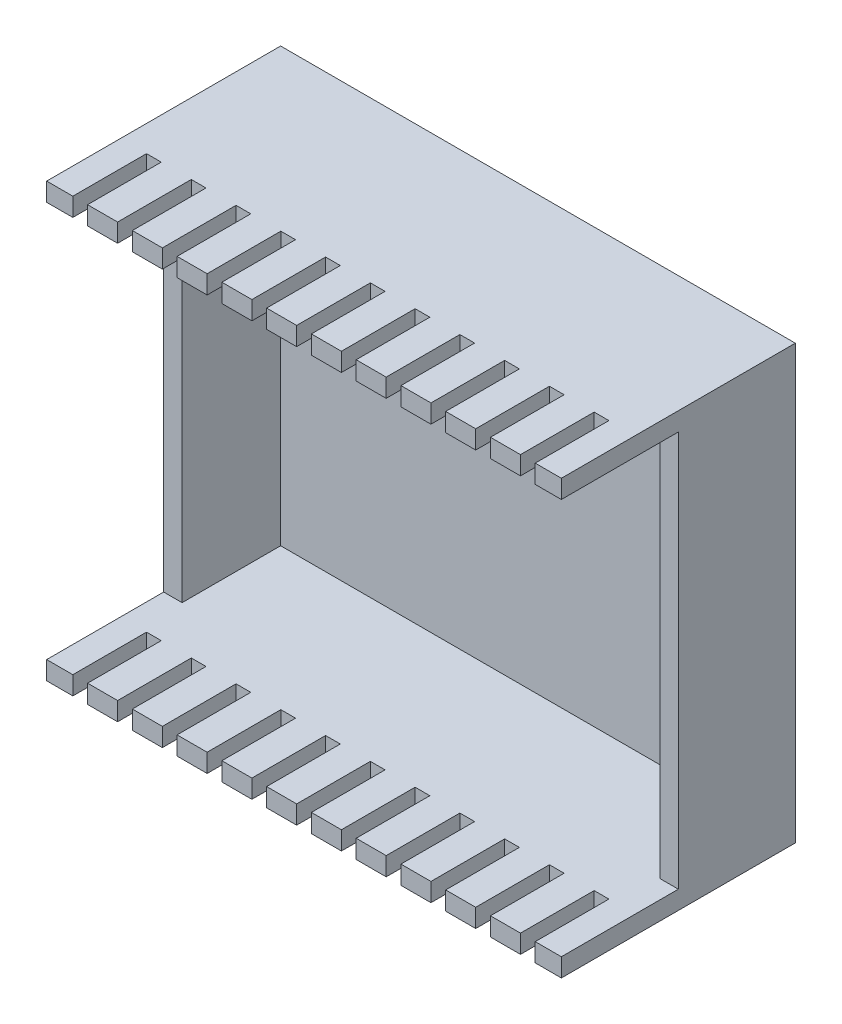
ISO-10303-21;
HEADER;
FILE_DESCRIPTION(('STEP AP214'),'2;1');
FILE_NAME('part.step','',(''),(''),'','','');
FILE_SCHEMA(('AUTOMOTIVE_DESIGN { 1 0 10303 214 1 1 1 1 }'));
ENDSEC;
DATA;
#1=APPLICATION_CONTEXT('core data for automotive mechanical design processes');
#2=APPLICATION_PROTOCOL_DEFINITION('international standard','automotive_design',2000,#1);
#3=PRODUCT_CONTEXT('',#1,'mechanical');
#4=PRODUCT('Part','Part','',(#3));
#5=PRODUCT_RELATED_PRODUCT_CATEGORY('part','',(#4));
#6=PRODUCT_DEFINITION_FORMATION('','',#4);
#7=PRODUCT_DEFINITION_CONTEXT('part definition',#1,'design');
#8=PRODUCT_DEFINITION('design','',#6,#7);
#9=PRODUCT_DEFINITION_SHAPE('','',#8);
#10=(LENGTH_UNIT() NAMED_UNIT(*) SI_UNIT(.MILLI.,.METRE.));
#11=(NAMED_UNIT(*) PLANE_ANGLE_UNIT() SI_UNIT($,.RADIAN.));
#12=(NAMED_UNIT(*) SI_UNIT($,.STERADIAN.) SOLID_ANGLE_UNIT());
#13=UNCERTAINTY_MEASURE_WITH_UNIT(LENGTH_MEASURE(1.E-05),#10,'distance_accuracy_value','');
#14=(GEOMETRIC_REPRESENTATION_CONTEXT(3) GLOBAL_UNCERTAINTY_ASSIGNED_CONTEXT((#13)) GLOBAL_UNIT_ASSIGNED_CONTEXT((#10,
#11,#12)) REPRESENTATION_CONTEXT('',''));
#15=CARTESIAN_POINT('',(0.,0.,0.));
#16=DIRECTION('',(0.,0.,1.));
#17=DIRECTION('',(1.,0.,0.));
#18=AXIS2_PLACEMENT_3D('',#15,#16,#17);
#19=CARTESIAN_POINT('',(0.,0.,12.7));
#20=DIRECTION('',(0.,0.,1.));
#21=DIRECTION('',(1.,0.,0.));
#22=AXIS2_PLACEMENT_3D('',#19,#20,#21);
#23=PLANE('',#22);
#24=DIRECTION('',(0.,1.,0.));
#25=VECTOR('',#24,1.);
#26=CARTESIAN_POINT('',(13.97,11.7475,12.7));
#27=LINE('',#26,#25);
#28=CARTESIAN_POINT('',(13.97,-11.7475,12.7));
#29=VERTEX_POINT('',#28);
#30=CARTESIAN_POINT('',(13.97,-10.7475,12.7));
#31=VERTEX_POINT('',#30);
#32=EDGE_CURVE('E1146',#29,#31,#27,.T.);
#33=ORIENTED_EDGE('',*,*,#32,.T.);
#34=DIRECTION('',(1.,0.,0.));
#35=VECTOR('',#34,1.);
#36=CARTESIAN_POINT('',(-12.97,-10.7475,12.7));
#37=LINE('',#36,#35);
#38=CARTESIAN_POINT('',(12.55,-10.7475,12.7));
#39=VERTEX_POINT('',#38);
#40=EDGE_CURVE('E665',#39,#31,#37,.T.);
#41=ORIENTED_EDGE('',*,*,#40,.F.);
#42=DIRECTION('',(0.,1.,0.));
#43=VECTOR('',#42,1.);
#44=CARTESIAN_POINT('',(12.55,0.,12.7));
#45=LINE('',#44,#43);
#46=CARTESIAN_POINT('',(12.55,-11.7475,12.7));
#47=VERTEX_POINT('',#46);
#48=EDGE_CURVE('E1092',#47,#39,#45,.T.);
#49=ORIENTED_EDGE('',*,*,#48,.F.);
#50=DIRECTION('',(1.,0.,0.));
#51=VECTOR('',#50,1.);
#52=CARTESIAN_POINT('',(-13.97,-11.7475,12.7));
#53=LINE('',#52,#51);
#54=EDGE_CURVE('E682',#47,#29,#53,.T.);
#55=ORIENTED_EDGE('',*,*,#54,.T.);
#56=EDGE_LOOP('',(#33,#41,#49,#55));
#57=FACE_BOUND('',#56,.T.);
#58=ADVANCED_FACE('F35',(#57),#23,.T.);
#59=CARTESIAN_POINT('',(-13.97,-10.7475,12.7));
#60=VERTEX_POINT('',#59);
#61=CARTESIAN_POINT('',(-12.55,-10.7475,12.7));
#62=VERTEX_POINT('',#61);
#63=EDGE_CURVE('E652',#60,#62,#37,.T.);
#64=ORIENTED_EDGE('',*,*,#63,.F.);
#65=DIRECTION('',(0.,-1.,0.));
#66=VECTOR('',#65,1.);
#67=CARTESIAN_POINT('',(-13.97,11.7475,12.7));
#68=LINE('',#67,#66);
#69=CARTESIAN_POINT('',(-13.97,-11.7475,12.7));
#70=VERTEX_POINT('',#69);
#71=EDGE_CURVE('E657',#60,#70,#68,.T.);
#72=ORIENTED_EDGE('',*,*,#71,.T.);
#73=CARTESIAN_POINT('',(-12.55,-11.7475,12.7));
#74=VERTEX_POINT('',#73);
#75=EDGE_CURVE('E689',#70,#74,#53,.T.);
#76=ORIENTED_EDGE('',*,*,#75,.T.);
#77=DIRECTION('',(0.,-1.,0.));
#78=VECTOR('',#77,1.);
#79=CARTESIAN_POINT('',(-12.55,0.,12.7));
#80=LINE('',#79,#78);
#81=EDGE_CURVE('E659',#62,#74,#80,.T.);
#82=ORIENTED_EDGE('',*,*,#81,.F.);
#83=EDGE_LOOP('',(#64,#72,#76,#82));
#84=FACE_BOUND('',#83,.T.);
#85=ADVANCED_FACE('F654',(#84),#23,.T.);
#86=CARTESIAN_POINT('',(12.97,10.7475,-33.6885533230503));
#87=DIRECTION('',(1.,0.,0.));
#88=DIRECTION('',(0.,0.,-1.));
#89=AXIS2_PLACEMENT_3D('',#86,#87,#88);
#90=PLANE('',#89);
#91=DIRECTION('',(0.,-1.,0.));
#92=VECTOR('',#91,1.);
#93=CARTESIAN_POINT('',(12.97,10.7475,6.35));
#94=LINE('',#93,#92);
#95=CARTESIAN_POINT('',(12.97,10.7475,6.35));
#96=VERTEX_POINT('',#95);
#97=CARTESIAN_POINT('',(12.97,-10.7475,6.35));
#98=VERTEX_POINT('',#97);
#99=EDGE_CURVE('E1395',#96,#98,#94,.T.);
#100=ORIENTED_EDGE('',*,*,#99,.F.);
#101=DIRECTION('',(0.,0.,1.));
#102=VECTOR('',#101,1.);
#103=CARTESIAN_POINT('',(12.97,10.7475,-33.6885533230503));
#104=LINE('',#103,#102);
#105=CARTESIAN_POINT('',(12.97,10.7475,1.));
#106=VERTEX_POINT('',#105);
#107=EDGE_CURVE('E662',#106,#96,#104,.T.);
#108=ORIENTED_EDGE('',*,*,#107,.F.);
#109=DIRECTION('',(0.,-1.,0.));
#110=VECTOR('',#109,1.);
#111=CARTESIAN_POINT('',(12.97,10.7475,1.));
#112=LINE('',#111,#110);
#113=CARTESIAN_POINT('',(12.97,-10.7475,1.));
#114=VERTEX_POINT('',#113);
#115=EDGE_CURVE('E1130',#106,#114,#112,.T.);
#116=ORIENTED_EDGE('',*,*,#115,.T.);
#117=DIRECTION('',(0.,0.,1.));
#118=VECTOR('',#117,1.);
#119=CARTESIAN_POINT('',(12.97,-10.7475,-33.6885533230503));
#120=LINE('',#119,#118);
#121=EDGE_CURVE('E1128',#114,#98,#120,.T.);
#122=ORIENTED_EDGE('',*,*,#121,.T.);
#123=EDGE_LOOP('',(#100,#108,#116,#122));
#124=FACE_BOUND('',#123,.T.);
#125=ADVANCED_FACE('F1520',(#124),#90,.F.);
#126=CARTESIAN_POINT('',(-12.97,10.7475,-33.6885533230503));
#127=DIRECTION('',(-1.,0.,0.));
#128=DIRECTION('',(0.,0.,1.));
#129=AXIS2_PLACEMENT_3D('',#126,#127,#128);
#130=PLANE('',#129);
#131=DIRECTION('',(0.,1.,0.));
#132=VECTOR('',#131,1.);
#133=CARTESIAN_POINT('',(-12.97,10.7475,6.35));
#134=LINE('',#133,#132);
#135=CARTESIAN_POINT('',(-12.97,-10.7475,6.35));
#136=VERTEX_POINT('',#135);
#137=CARTESIAN_POINT('',(-12.97,10.7475,6.35));
#138=VERTEX_POINT('',#137);
#139=EDGE_CURVE('E1393',#136,#138,#134,.T.);
#140=ORIENTED_EDGE('',*,*,#139,.F.);
#141=DIRECTION('',(0.,0.,1.));
#142=VECTOR('',#141,1.);
#143=CARTESIAN_POINT('',(-12.97,-10.7475,-33.6885533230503));
#144=LINE('',#143,#142);
#145=CARTESIAN_POINT('',(-12.97,-10.7475,1.));
#146=VERTEX_POINT('',#145);
#147=EDGE_CURVE('E1139',#146,#136,#144,.T.);
#148=ORIENTED_EDGE('',*,*,#147,.F.);
#149=DIRECTION('',(0.,1.,0.));
#150=VECTOR('',#149,1.);
#151=CARTESIAN_POINT('',(-12.97,10.7475,1.));
#152=LINE('',#151,#150);
#153=CARTESIAN_POINT('',(-12.97,10.7475,1.));
#154=VERTEX_POINT('',#153);
#155=EDGE_CURVE('E1125',#146,#154,#152,.T.);
#156=ORIENTED_EDGE('',*,*,#155,.T.);
#157=DIRECTION('',(0.,0.,1.));
#158=VECTOR('',#157,1.);
#159=CARTESIAN_POINT('',(-12.97,10.7475,-33.6885533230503));
#160=LINE('',#159,#158);
#161=EDGE_CURVE('E1141',#154,#138,#160,.T.);
#162=ORIENTED_EDGE('',*,*,#161,.T.);
#163=EDGE_LOOP('',(#140,#148,#156,#162));
#164=FACE_BOUND('',#163,.T.);
#165=ADVANCED_FACE('F1510',(#164),#130,.F.);
#166=DIRECTION('',(0.,1.,0.));
#167=VECTOR('',#166,1.);
#168=CARTESIAN_POINT('',(-6.89,0.,12.7));
#169=LINE('',#168,#167);
#170=CARTESIAN_POINT('',(-6.88999999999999,10.7475,12.7));
#171=VERTEX_POINT('',#170);
#172=CARTESIAN_POINT('',(-6.89,11.7475,12.7));
#173=VERTEX_POINT('',#172);
#174=EDGE_CURVE('E1119',#171,#173,#169,.T.);
#175=ORIENTED_EDGE('',*,*,#174,.F.);
#176=DIRECTION('',(-1.,0.,0.));
#177=VECTOR('',#176,1.);
#178=CARTESIAN_POINT('',(-12.97,10.7475,12.7));
#179=LINE('',#178,#177);
#180=CARTESIAN_POINT('',(-5.26,10.7475,12.7));
#181=VERTEX_POINT('',#180);
#182=EDGE_CURVE('E1365',#181,#171,#179,.T.);
#183=ORIENTED_EDGE('',*,*,#182,.F.);
#184=DIRECTION('',(0.,-1.,0.));
#185=VECTOR('',#184,1.);
#186=CARTESIAN_POINT('',(-5.25999999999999,0.,12.7));
#187=LINE('',#186,#185);
#188=CARTESIAN_POINT('',(-5.25999999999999,11.7475,12.7));
#189=VERTEX_POINT('',#188);
#190=EDGE_CURVE('E992',#189,#181,#187,.T.);
#191=ORIENTED_EDGE('',*,*,#190,.F.);
#192=DIRECTION('',(-1.,0.,0.));
#193=VECTOR('',#192,1.);
#194=CARTESIAN_POINT('',(-13.97,11.7475,12.7));
#195=LINE('',#194,#193);
#196=EDGE_CURVE('E1202',#189,#173,#195,.T.);
#197=ORIENTED_EDGE('',*,*,#196,.T.);
#198=EDGE_LOOP('',(#175,#183,#191,#197));
#199=FACE_BOUND('',#198,.T.);
#200=ADVANCED_FACE('F1534',(#199),#23,.T.);
#201=CARTESIAN_POINT('',(-6.89,-11.7475,12.7));
#202=VERTEX_POINT('',#201);
#203=CARTESIAN_POINT('',(-6.88999999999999,-10.7475,12.7));
#204=VERTEX_POINT('',#203);
#205=EDGE_CURVE('E1122',#202,#204,#169,.T.);
#206=ORIENTED_EDGE('',*,*,#205,.F.);
#207=CARTESIAN_POINT('',(-5.25999999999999,-11.7475,12.7));
#208=VERTEX_POINT('',#207);
#209=EDGE_CURVE('E1353',#202,#208,#53,.T.);
#210=ORIENTED_EDGE('',*,*,#209,.T.);
#211=CARTESIAN_POINT('',(-5.25999999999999,-10.7475,12.7));
#212=VERTEX_POINT('',#211);
#213=EDGE_CURVE('E995',#212,#208,#187,.T.);
#214=ORIENTED_EDGE('',*,*,#213,.F.);
#215=EDGE_CURVE('E1362',#204,#212,#37,.T.);
#216=ORIENTED_EDGE('',*,*,#215,.F.);
#217=EDGE_LOOP('',(#206,#210,#214,#216));
#218=FACE_BOUND('',#217,.T.);
#219=ADVANCED_FACE('F1359',(#218),#23,.T.);
#220=DIRECTION('',(0.,-1.,0.));
#221=VECTOR('',#220,1.);
#222=CARTESIAN_POINT('',(-7.68999999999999,0.,12.7));
#223=LINE('',#222,#221);
#224=CARTESIAN_POINT('',(-7.68999999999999,11.7475,12.7));
#225=VERTEX_POINT('',#224);
#226=CARTESIAN_POINT('',(-7.69,10.7475,12.7));
#227=VERTEX_POINT('',#226);
#228=EDGE_CURVE('E1110',#225,#227,#223,.T.);
#229=ORIENTED_EDGE('',*,*,#228,.F.);
#230=CARTESIAN_POINT('',(-9.31999999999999,11.7475,12.7));
#231=VERTEX_POINT('',#230);
#232=EDGE_CURVE('E1200',#225,#231,#195,.T.);
#233=ORIENTED_EDGE('',*,*,#232,.T.);
#234=DIRECTION('',(0.,1.,0.));
#235=VECTOR('',#234,1.);
#236=CARTESIAN_POINT('',(-9.31999999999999,0.,12.7));
#237=LINE('',#236,#235);
#238=CARTESIAN_POINT('',(-9.31999999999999,10.7475,12.7));
#239=VERTEX_POINT('',#238);
#240=EDGE_CURVE('E1104',#239,#231,#237,.T.);
#241=ORIENTED_EDGE('',*,*,#240,.F.);
#242=EDGE_CURVE('E1364',#227,#239,#179,.T.);
#243=ORIENTED_EDGE('',*,*,#242,.F.);
#244=EDGE_LOOP('',(#229,#233,#241,#243));
#245=FACE_BOUND('',#244,.T.);
#246=ADVANCED_FACE('F1694',(#245),#23,.T.);
#247=CARTESIAN_POINT('',(-7.68999999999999,-10.7475,12.7));
#248=VERTEX_POINT('',#247);
#249=CARTESIAN_POINT('',(-7.68999999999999,-11.7475,12.7));
#250=VERTEX_POINT('',#249);
#251=EDGE_CURVE('E1113',#248,#250,#223,.T.);
#252=ORIENTED_EDGE('',*,*,#251,.F.);
#253=CARTESIAN_POINT('',(-9.31999999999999,-10.7475,12.7));
#254=VERTEX_POINT('',#253);
#255=EDGE_CURVE('E1662',#254,#248,#37,.T.);
#256=ORIENTED_EDGE('',*,*,#255,.F.);
#257=CARTESIAN_POINT('',(-9.31999999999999,-11.7475,12.7));
#258=VERTEX_POINT('',#257);
#259=EDGE_CURVE('E1107',#258,#254,#237,.T.);
#260=ORIENTED_EDGE('',*,*,#259,.F.);
#261=EDGE_CURVE('E1640',#258,#250,#53,.T.);
#262=ORIENTED_EDGE('',*,*,#261,.T.);
#263=EDGE_LOOP('',(#252,#256,#260,#262));
#264=FACE_BOUND('',#263,.T.);
#265=ADVANCED_FACE('F1665',(#264),#23,.T.);
#266=CARTESIAN_POINT('',(13.97,10.7475,12.7));
#267=VERTEX_POINT('',#266);
#268=CARTESIAN_POINT('',(12.55,10.7475,12.7));
#269=VERTEX_POINT('',#268);
#270=EDGE_CURVE('E1132',#267,#269,#179,.T.);
#271=ORIENTED_EDGE('',*,*,#270,.F.);
#272=CARTESIAN_POINT('',(13.97,11.7475,12.7));
#273=VERTEX_POINT('',#272);
#274=EDGE_CURVE('E703',#267,#273,#27,.T.);
#275=ORIENTED_EDGE('',*,*,#274,.T.);
#276=CARTESIAN_POINT('',(12.55,11.7475,12.7));
#277=VERTEX_POINT('',#276);
#278=EDGE_CURVE('E679',#273,#277,#195,.T.);
#279=ORIENTED_EDGE('',*,*,#278,.T.);
#280=EDGE_CURVE('E1089',#269,#277,#45,.T.);
#281=ORIENTED_EDGE('',*,*,#280,.F.);
#282=EDGE_LOOP('',(#271,#275,#279,#281));
#283=FACE_BOUND('',#282,.T.);
#284=ADVANCED_FACE('F1155',(#283),#23,.T.);
#285=DIRECTION('',(0.,-1.,0.));
#286=VECTOR('',#285,1.);
#287=CARTESIAN_POINT('',(11.75,0.,12.7));
#288=LINE('',#287,#286);
#289=CARTESIAN_POINT('',(11.75,11.7475,12.7));
#290=VERTEX_POINT('',#289);
#291=CARTESIAN_POINT('',(11.75,10.7475,12.7));
#292=VERTEX_POINT('',#291);
#293=EDGE_CURVE('E1080',#290,#292,#288,.T.);
#294=ORIENTED_EDGE('',*,*,#293,.F.);
#295=CARTESIAN_POINT('',(10.12,11.7475,12.7));
#296=VERTEX_POINT('',#295);
#297=EDGE_CURVE('E684',#290,#296,#195,.T.);
#298=ORIENTED_EDGE('',*,*,#297,.T.);
#299=DIRECTION('',(0.,1.,0.));
#300=VECTOR('',#299,1.);
#301=CARTESIAN_POINT('',(10.12,0.,12.7));
#302=LINE('',#301,#300);
#303=CARTESIAN_POINT('',(10.12,10.7475,12.7));
#304=VERTEX_POINT('',#303);
#305=EDGE_CURVE('E1074',#304,#296,#302,.T.);
#306=ORIENTED_EDGE('',*,*,#305,.F.);
#307=EDGE_CURVE('E1134',#292,#304,#179,.T.);
#308=ORIENTED_EDGE('',*,*,#307,.F.);
#309=EDGE_LOOP('',(#294,#298,#306,#308));
#310=FACE_BOUND('',#309,.T.);
#311=ADVANCED_FACE('F1252',(#310),#23,.T.);
#312=CARTESIAN_POINT('',(11.75,-10.7475,12.7));
#313=VERTEX_POINT('',#312);
#314=CARTESIAN_POINT('',(11.75,-11.7475,12.7));
#315=VERTEX_POINT('',#314);
#316=EDGE_CURVE('E1083',#313,#315,#288,.T.);
#317=ORIENTED_EDGE('',*,*,#316,.F.);
#318=CARTESIAN_POINT('',(10.12,-10.7475,12.7));
#319=VERTEX_POINT('',#318);
#320=EDGE_CURVE('E1492',#319,#313,#37,.T.);
#321=ORIENTED_EDGE('',*,*,#320,.F.);
#322=CARTESIAN_POINT('',(10.12,-11.7475,12.7));
#323=VERTEX_POINT('',#322);
#324=EDGE_CURVE('E1077',#323,#319,#302,.T.);
#325=ORIENTED_EDGE('',*,*,#324,.F.);
#326=EDGE_CURVE('E1624',#323,#315,#53,.T.);
#327=ORIENTED_EDGE('',*,*,#326,.T.);
#328=EDGE_LOOP('',(#317,#321,#325,#327));
#329=FACE_BOUND('',#328,.T.);
#330=ADVANCED_FACE('F1622',(#329),#23,.T.);
#331=DIRECTION('',(0.,-1.,0.));
#332=VECTOR('',#331,1.);
#333=CARTESIAN_POINT('',(9.32,0.,12.7));
#334=LINE('',#333,#332);
#335=CARTESIAN_POINT('',(9.32,11.7475,12.7));
#336=VERTEX_POINT('',#335);
#337=CARTESIAN_POINT('',(9.31999999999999,10.7475,12.7));
#338=VERTEX_POINT('',#337);
#339=EDGE_CURVE('E1065',#336,#338,#334,.T.);
#340=ORIENTED_EDGE('',*,*,#339,.F.);
#341=CARTESIAN_POINT('',(7.69,11.7475,12.7));
#342=VERTEX_POINT('',#341);
#343=EDGE_CURVE('E1237',#336,#342,#195,.T.);
#344=ORIENTED_EDGE('',*,*,#343,.T.);
#345=DIRECTION('',(0.,1.,0.));
#346=VECTOR('',#345,1.);
#347=CARTESIAN_POINT('',(7.69,0.,12.7));
#348=LINE('',#347,#346);
#349=CARTESIAN_POINT('',(7.69,10.7475,12.7));
#350=VERTEX_POINT('',#349);
#351=EDGE_CURVE('E1059',#350,#342,#348,.T.);
#352=ORIENTED_EDGE('',*,*,#351,.F.);
#353=EDGE_CURVE('E1381',#338,#350,#179,.T.);
#354=ORIENTED_EDGE('',*,*,#353,.F.);
#355=EDGE_LOOP('',(#340,#344,#352,#354));
#356=FACE_BOUND('',#355,.T.);
#357=ADVANCED_FACE('F2222',(#356),#23,.T.);
#358=CARTESIAN_POINT('',(9.32,-10.7475,12.7));
#359=VERTEX_POINT('',#358);
#360=CARTESIAN_POINT('',(9.32,-11.7475,12.7));
#361=VERTEX_POINT('',#360);
#362=EDGE_CURVE('E1068',#359,#361,#334,.T.);
#363=ORIENTED_EDGE('',*,*,#362,.F.);
#364=CARTESIAN_POINT('',(7.69,-10.7475,12.7));
#365=VERTEX_POINT('',#364);
#366=EDGE_CURVE('E1489',#365,#359,#37,.T.);
#367=ORIENTED_EDGE('',*,*,#366,.F.);
#368=CARTESIAN_POINT('',(7.69,-11.7475,12.7));
#369=VERTEX_POINT('',#368);
#370=EDGE_CURVE('E1062',#369,#365,#348,.T.);
#371=ORIENTED_EDGE('',*,*,#370,.F.);
#372=EDGE_CURVE('E1607',#369,#361,#53,.T.);
#373=ORIENTED_EDGE('',*,*,#372,.T.);
#374=EDGE_LOOP('',(#363,#367,#371,#373));
#375=FACE_BOUND('',#374,.T.);
#376=ADVANCED_FACE('F1605',(#375),#23,.T.);
#377=DIRECTION('',(0.,-1.,0.));
#378=VECTOR('',#377,1.);
#379=CARTESIAN_POINT('',(6.89,0.,12.7));
#380=LINE('',#379,#378);
#381=CARTESIAN_POINT('',(6.89,11.7475,12.7));
#382=VERTEX_POINT('',#381);
#383=CARTESIAN_POINT('',(6.88999999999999,10.7475,12.7));
#384=VERTEX_POINT('',#383);
#385=EDGE_CURVE('E1050',#382,#384,#380,.T.);
#386=ORIENTED_EDGE('',*,*,#385,.F.);
#387=CARTESIAN_POINT('',(5.26,11.7475,12.7));
#388=VERTEX_POINT('',#387);
#389=EDGE_CURVE('E1231',#382,#388,#195,.T.);
#390=ORIENTED_EDGE('',*,*,#389,.T.);
#391=DIRECTION('',(0.,1.,0.));
#392=VECTOR('',#391,1.);
#393=CARTESIAN_POINT('',(5.26,0.,12.7));
#394=LINE('',#393,#392);
#395=CARTESIAN_POINT('',(5.26,10.7475,12.7));
#396=VERTEX_POINT('',#395);
#397=EDGE_CURVE('E1044',#396,#388,#394,.T.);
#398=ORIENTED_EDGE('',*,*,#397,.F.);
#399=EDGE_CURVE('E1378',#384,#396,#179,.T.);
#400=ORIENTED_EDGE('',*,*,#399,.F.);
#401=EDGE_LOOP('',(#386,#390,#398,#400));
#402=FACE_BOUND('',#401,.T.);
#403=ADVANCED_FACE('F2207',(#402),#23,.T.);
#404=CARTESIAN_POINT('',(6.89,-10.7475,12.7));
#405=VERTEX_POINT('',#404);
#406=CARTESIAN_POINT('',(6.89,-11.7475,12.7));
#407=VERTEX_POINT('',#406);
#408=EDGE_CURVE('E1053',#405,#407,#380,.T.);
#409=ORIENTED_EDGE('',*,*,#408,.F.);
#410=CARTESIAN_POINT('',(5.26,-10.7475,12.7));
#411=VERTEX_POINT('',#410);
#412=EDGE_CURVE('E1486',#411,#405,#37,.T.);
#413=ORIENTED_EDGE('',*,*,#412,.F.);
#414=CARTESIAN_POINT('',(5.26,-11.7475,12.7));
#415=VERTEX_POINT('',#414);
#416=EDGE_CURVE('E1047',#415,#411,#394,.T.);
#417=ORIENTED_EDGE('',*,*,#416,.F.);
#418=EDGE_CURVE('E1590',#415,#407,#53,.T.);
#419=ORIENTED_EDGE('',*,*,#418,.T.);
#420=EDGE_LOOP('',(#409,#413,#417,#419));
#421=FACE_BOUND('',#420,.T.);
#422=ADVANCED_FACE('F1588',(#421),#23,.T.);
#423=DIRECTION('',(0.,-1.,0.));
#424=VECTOR('',#423,1.);
#425=CARTESIAN_POINT('',(4.46,0.,12.7));
#426=LINE('',#425,#424);
#427=CARTESIAN_POINT('',(4.46,11.7475,12.7));
#428=VERTEX_POINT('',#427);
#429=CARTESIAN_POINT('',(4.45999999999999,10.7475,12.7));
#430=VERTEX_POINT('',#429);
#431=EDGE_CURVE('E1035',#428,#430,#426,.T.);
#432=ORIENTED_EDGE('',*,*,#431,.F.);
#433=CARTESIAN_POINT('',(2.83,11.7475,12.7));
#434=VERTEX_POINT('',#433);
#435=EDGE_CURVE('E1225',#428,#434,#195,.T.);
#436=ORIENTED_EDGE('',*,*,#435,.T.);
#437=DIRECTION('',(0.,1.,0.));
#438=VECTOR('',#437,1.);
#439=CARTESIAN_POINT('',(2.83,0.,12.7));
#440=LINE('',#439,#438);
#441=CARTESIAN_POINT('',(2.83,10.7475,12.7));
#442=VERTEX_POINT('',#441);
#443=EDGE_CURVE('E1029',#442,#434,#440,.T.);
#444=ORIENTED_EDGE('',*,*,#443,.F.);
#445=EDGE_CURVE('E1375',#430,#442,#179,.T.);
#446=ORIENTED_EDGE('',*,*,#445,.F.);
#447=EDGE_LOOP('',(#432,#436,#444,#446));
#448=FACE_BOUND('',#447,.T.);
#449=ADVANCED_FACE('F2192',(#448),#23,.T.);
#450=CARTESIAN_POINT('',(4.46,-10.7475,12.7));
#451=VERTEX_POINT('',#450);
#452=CARTESIAN_POINT('',(4.46,-11.7475,12.7));
#453=VERTEX_POINT('',#452);
#454=EDGE_CURVE('E1038',#451,#453,#426,.T.);
#455=ORIENTED_EDGE('',*,*,#454,.F.);
#456=CARTESIAN_POINT('',(2.83,-10.7475,12.7));
#457=VERTEX_POINT('',#456);
#458=EDGE_CURVE('E1483',#457,#451,#37,.T.);
#459=ORIENTED_EDGE('',*,*,#458,.F.);
#460=CARTESIAN_POINT('',(2.83,-11.7475,12.7));
#461=VERTEX_POINT('',#460);
#462=EDGE_CURVE('E1032',#461,#457,#440,.T.);
#463=ORIENTED_EDGE('',*,*,#462,.F.);
#464=EDGE_CURVE('E1573',#461,#453,#53,.T.);
#465=ORIENTED_EDGE('',*,*,#464,.T.);
#466=EDGE_LOOP('',(#455,#459,#463,#465));
#467=FACE_BOUND('',#466,.T.);
#468=ADVANCED_FACE('F1571',(#467),#23,.T.);
#469=DIRECTION('',(0.,-1.,0.));
#470=VECTOR('',#469,1.);
#471=CARTESIAN_POINT('',(2.03,0.,12.7));
#472=LINE('',#471,#470);
#473=CARTESIAN_POINT('',(2.03,11.7475,12.7));
#474=VERTEX_POINT('',#473);
#475=CARTESIAN_POINT('',(2.03,10.7475,12.7));
#476=VERTEX_POINT('',#475);
#477=EDGE_CURVE('E1020',#474,#476,#472,.T.);
#478=ORIENTED_EDGE('',*,*,#477,.F.);
#479=CARTESIAN_POINT('',(0.4,11.7475,12.7));
#480=VERTEX_POINT('',#479);
#481=EDGE_CURVE('E1219',#474,#480,#195,.T.);
#482=ORIENTED_EDGE('',*,*,#481,.T.);
#483=DIRECTION('',(0.,1.,0.));
#484=VECTOR('',#483,1.);
#485=CARTESIAN_POINT('',(0.4,0.,12.7));
#486=LINE('',#485,#484);
#487=CARTESIAN_POINT('',(0.400000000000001,10.7475,12.7));
#488=VERTEX_POINT('',#487);
#489=EDGE_CURVE('E971',#488,#480,#486,.T.);
#490=ORIENTED_EDGE('',*,*,#489,.F.);
#491=EDGE_CURVE('E1372',#476,#488,#179,.T.);
#492=ORIENTED_EDGE('',*,*,#491,.F.);
#493=EDGE_LOOP('',(#478,#482,#490,#492));
#494=FACE_BOUND('',#493,.T.);
#495=ADVANCED_FACE('F2177',(#494),#23,.T.);
#496=DIRECTION('',(0.,-1.,0.));
#497=VECTOR('',#496,1.);
#498=CARTESIAN_POINT('',(-10.12,0.,12.7));
#499=LINE('',#498,#497);
#500=CARTESIAN_POINT('',(-10.12,11.7475,12.7));
#501=VERTEX_POINT('',#500);
#502=CARTESIAN_POINT('',(-10.12,10.7475,12.7));
#503=VERTEX_POINT('',#502);
#504=EDGE_CURVE('E1095',#501,#503,#499,.T.);
#505=ORIENTED_EDGE('',*,*,#504,.F.);
#506=CARTESIAN_POINT('',(-11.75,11.7475,12.7));
#507=VERTEX_POINT('',#506);
#508=EDGE_CURVE('E1151',#501,#507,#195,.T.);
#509=ORIENTED_EDGE('',*,*,#508,.T.);
#510=DIRECTION('',(0.,1.,0.));
#511=VECTOR('',#510,1.);
#512=CARTESIAN_POINT('',(-11.75,0.,12.7));
#513=LINE('',#512,#511);
#514=CARTESIAN_POINT('',(-11.75,10.7475,12.7));
#515=VERTEX_POINT('',#514);
#516=EDGE_CURVE('E1014',#515,#507,#513,.T.);
#517=ORIENTED_EDGE('',*,*,#516,.F.);
#518=EDGE_CURVE('E1363',#503,#515,#179,.T.);
#519=ORIENTED_EDGE('',*,*,#518,.F.);
#520=EDGE_LOOP('',(#505,#509,#517,#519));
#521=FACE_BOUND('',#520,.T.);
#522=ADVANCED_FACE('F1197',(#521),#23,.T.);
#523=CARTESIAN_POINT('',(-10.12,-10.7475,12.7));
#524=VERTEX_POINT('',#523);
#525=CARTESIAN_POINT('',(-10.12,-11.7475,12.7));
#526=VERTEX_POINT('',#525);
#527=EDGE_CURVE('E1098',#524,#526,#499,.T.);
#528=ORIENTED_EDGE('',*,*,#527,.F.);
#529=CARTESIAN_POINT('',(-11.75,-10.7475,12.7));
#530=VERTEX_POINT('',#529);
#531=EDGE_CURVE('E663',#530,#524,#37,.T.);
#532=ORIENTED_EDGE('',*,*,#531,.F.);
#533=CARTESIAN_POINT('',(-11.75,-11.7475,12.7));
#534=VERTEX_POINT('',#533);
#535=EDGE_CURVE('E1017',#534,#530,#513,.T.);
#536=ORIENTED_EDGE('',*,*,#535,.F.);
#537=EDGE_CURVE('E692',#534,#526,#53,.T.);
#538=ORIENTED_EDGE('',*,*,#537,.T.);
#539=EDGE_LOOP('',(#528,#532,#536,#538));
#540=FACE_BOUND('',#539,.T.);
#541=ADVANCED_FACE('F1651',(#540),#23,.T.);
#542=DIRECTION('',(0.,1.,0.));
#543=VECTOR('',#542,1.);
#544=CARTESIAN_POINT('',(-4.45999999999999,0.,12.7));
#545=LINE('',#544,#543);
#546=CARTESIAN_POINT('',(-4.45999999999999,10.7475,12.7));
#547=VERTEX_POINT('',#546);
#548=CARTESIAN_POINT('',(-4.45999999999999,11.7475,12.7));
#549=VERTEX_POINT('',#548);
#550=EDGE_CURVE('E1001',#547,#549,#545,.T.);
#551=ORIENTED_EDGE('',*,*,#550,.F.);
#552=CARTESIAN_POINT('',(-2.83,10.7475,12.7));
#553=VERTEX_POINT('',#552);
#554=EDGE_CURVE('E1366',#553,#547,#179,.T.);
#555=ORIENTED_EDGE('',*,*,#554,.F.);
#556=DIRECTION('',(0.,-1.,0.));
#557=VECTOR('',#556,1.);
#558=CARTESIAN_POINT('',(-2.82999999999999,0.,12.7));
#559=LINE('',#558,#557);
#560=CARTESIAN_POINT('',(-2.82999999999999,11.7475,12.7));
#561=VERTEX_POINT('',#560);
#562=EDGE_CURVE('E977',#561,#553,#559,.T.);
#563=ORIENTED_EDGE('',*,*,#562,.F.);
#564=EDGE_CURVE('E1208',#561,#549,#195,.T.);
#565=ORIENTED_EDGE('',*,*,#564,.T.);
#566=EDGE_LOOP('',(#551,#555,#563,#565));
#567=FACE_BOUND('',#566,.T.);
#568=ADVANCED_FACE('F1747',(#567),#23,.T.);
#569=CARTESIAN_POINT('',(-4.45999999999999,-11.7475,12.7));
#570=VERTEX_POINT('',#569);
#571=CARTESIAN_POINT('',(-4.45999999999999,-10.7475,12.7));
#572=VERTEX_POINT('',#571);
#573=EDGE_CURVE('E1004',#570,#572,#545,.T.);
#574=ORIENTED_EDGE('',*,*,#573,.F.);
#575=CARTESIAN_POINT('',(-2.82999999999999,-11.7475,12.7));
#576=VERTEX_POINT('',#575);
#577=EDGE_CURVE('E1637',#570,#576,#53,.T.);
#578=ORIENTED_EDGE('',*,*,#577,.T.);
#579=CARTESIAN_POINT('',(-2.82999999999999,-10.7475,12.7));
#580=VERTEX_POINT('',#579);
#581=EDGE_CURVE('E980',#580,#576,#559,.T.);
#582=ORIENTED_EDGE('',*,*,#581,.F.);
#583=EDGE_CURVE('E1479',#572,#580,#37,.T.);
#584=ORIENTED_EDGE('',*,*,#583,.F.);
#585=EDGE_LOOP('',(#574,#578,#582,#584));
#586=FACE_BOUND('',#585,.T.);
#587=ADVANCED_FACE('F1784',(#586),#23,.T.);
#588=DIRECTION('',(0.,1.,0.));
#589=VECTOR('',#588,1.);
#590=CARTESIAN_POINT('',(-2.02999999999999,0.,12.7));
#591=LINE('',#590,#589);
#592=CARTESIAN_POINT('',(-2.02999999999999,10.7475,12.7));
#593=VERTEX_POINT('',#592);
#594=CARTESIAN_POINT('',(-2.02999999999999,11.7475,12.7));
#595=VERTEX_POINT('',#594);
#596=EDGE_CURVE('E986',#593,#595,#591,.T.);
#597=ORIENTED_EDGE('',*,*,#596,.F.);
#598=CARTESIAN_POINT('',(-0.400000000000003,10.7475,12.7));
#599=VERTEX_POINT('',#598);
#600=EDGE_CURVE('E1369',#599,#593,#179,.T.);
#601=ORIENTED_EDGE('',*,*,#600,.F.);
#602=DIRECTION('',(0.,-1.,0.));
#603=VECTOR('',#602,1.);
#604=CARTESIAN_POINT('',(-0.4,0.,12.7));
#605=LINE('',#604,#603);
#606=CARTESIAN_POINT('',(-0.4,11.7475,12.7));
#607=VERTEX_POINT('',#606);
#608=EDGE_CURVE('E958',#607,#599,#605,.T.);
#609=ORIENTED_EDGE('',*,*,#608,.F.);
#610=EDGE_CURVE('E1213',#607,#595,#195,.T.);
#611=ORIENTED_EDGE('',*,*,#610,.T.);
#612=EDGE_LOOP('',(#597,#601,#609,#611));
#613=FACE_BOUND('',#612,.T.);
#614=ADVANCED_FACE('F1550',(#613),#23,.T.);
#615=CARTESIAN_POINT('',(-2.02999999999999,-11.7475,12.7));
#616=VERTEX_POINT('',#615);
#617=CARTESIAN_POINT('',(-2.02999999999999,-10.7475,12.7));
#618=VERTEX_POINT('',#617);
#619=EDGE_CURVE('E989',#616,#618,#591,.T.);
#620=ORIENTED_EDGE('',*,*,#619,.F.);
#621=CARTESIAN_POINT('',(-0.4,-11.7475,12.7));
#622=VERTEX_POINT('',#621);
#623=EDGE_CURVE('E1470',#616,#622,#53,.T.);
#624=ORIENTED_EDGE('',*,*,#623,.T.);
#625=CARTESIAN_POINT('',(-0.4,-10.7475,12.7));
#626=VERTEX_POINT('',#625);
#627=EDGE_CURVE('E965',#626,#622,#605,.T.);
#628=ORIENTED_EDGE('',*,*,#627,.F.);
#629=EDGE_CURVE('E1478',#618,#626,#37,.T.);
#630=ORIENTED_EDGE('',*,*,#629,.F.);
#631=EDGE_LOOP('',(#620,#624,#628,#630));
#632=FACE_BOUND('',#631,.T.);
#633=ADVANCED_FACE('F1475',(#632),#23,.T.);
#634=CARTESIAN_POINT('',(2.03,-10.7475,12.7));
#635=VERTEX_POINT('',#634);
#636=CARTESIAN_POINT('',(2.03,-11.7475,12.7));
#637=VERTEX_POINT('',#636);
#638=EDGE_CURVE('E1023',#635,#637,#472,.T.);
#639=ORIENTED_EDGE('',*,*,#638,.F.);
#640=CARTESIAN_POINT('',(0.400000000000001,-10.7475,12.7));
#641=VERTEX_POINT('',#640);
#642=EDGE_CURVE('E1480',#641,#635,#37,.T.);
#643=ORIENTED_EDGE('',*,*,#642,.F.);
#644=CARTESIAN_POINT('',(0.4,-11.7475,12.7));
#645=VERTEX_POINT('',#644);
#646=EDGE_CURVE('E974',#645,#641,#486,.T.);
#647=ORIENTED_EDGE('',*,*,#646,.F.);
#648=EDGE_CURVE('E1555',#645,#637,#53,.T.);
#649=ORIENTED_EDGE('',*,*,#648,.T.);
#650=EDGE_LOOP('',(#639,#643,#647,#649));
#651=FACE_BOUND('',#650,.T.);
#652=ADVANCED_FACE('F1538',(#651),#23,.T.);
#653=CARTESIAN_POINT('',(13.97,11.7475,12.7));
#654=DIRECTION('',(-1.,0.,0.));
#655=DIRECTION('',(0.,0.,1.));
#656=AXIS2_PLACEMENT_3D('',#653,#654,#655);
#657=PLANE('',#656);
#658=DIRECTION('',(0.,1.,0.));
#659=VECTOR('',#658,1.);
#660=CARTESIAN_POINT('',(13.97,11.7475,6.35));
#661=LINE('',#660,#659);
#662=CARTESIAN_POINT('',(13.97,-10.7475,6.35));
#663=VERTEX_POINT('',#662);
#664=CARTESIAN_POINT('',(13.97,10.7475,6.35));
#665=VERTEX_POINT('',#664);
#666=EDGE_CURVE('E1403',#663,#665,#661,.T.);
#667=ORIENTED_EDGE('',*,*,#666,.F.);
#668=DIRECTION('',(0.,0.,1.));
#669=VECTOR('',#668,1.);
#670=CARTESIAN_POINT('',(13.97,-10.7475,12.7));
#671=LINE('',#670,#669);
#672=EDGE_CURVE('E672',#663,#31,#671,.T.);
#673=ORIENTED_EDGE('',*,*,#672,.T.);
#674=ORIENTED_EDGE('',*,*,#32,.F.);
#675=DIRECTION('',(0.,0.,-1.));
#676=VECTOR('',#675,1.);
#677=CARTESIAN_POINT('',(13.97,-11.7475,12.7));
#678=LINE('',#677,#676);
#679=CARTESIAN_POINT('',(13.97,-11.7475,0.));
#680=VERTEX_POINT('',#679);
#681=EDGE_CURVE('E691',#29,#680,#678,.T.);
#682=ORIENTED_EDGE('',*,*,#681,.T.);
#683=DIRECTION('',(0.,1.,0.));
#684=VECTOR('',#683,1.);
#685=CARTESIAN_POINT('',(13.97,11.7475,0.));
#686=LINE('',#685,#684);
#687=CARTESIAN_POINT('',(13.97,11.7475,0.));
#688=VERTEX_POINT('',#687);
#689=EDGE_CURVE('E693',#680,#688,#686,.T.);
#690=ORIENTED_EDGE('',*,*,#689,.T.);
#691=DIRECTION('',(0.,0.,-1.));
#692=VECTOR('',#691,1.);
#693=CARTESIAN_POINT('',(13.97,11.7475,12.7));
#694=LINE('',#693,#692);
#695=EDGE_CURVE('E710',#273,#688,#694,.T.);
#696=ORIENTED_EDGE('',*,*,#695,.F.);
#697=ORIENTED_EDGE('',*,*,#274,.F.);
#698=DIRECTION('',(0.,0.,-1.));
#699=VECTOR('',#698,1.);
#700=CARTESIAN_POINT('',(13.97,10.7475,12.7));
#701=LINE('',#700,#699);
#702=EDGE_CURVE('E1392',#267,#665,#701,.T.);
#703=ORIENTED_EDGE('',*,*,#702,.T.);
#704=EDGE_LOOP('',(#667,#673,#674,#682,#690,#696,#697,#703));
#705=FACE_BOUND('',#704,.T.);
#706=ADVANCED_FACE('F37',(#705),#657,.F.);
#707=CARTESIAN_POINT('',(-13.97,11.7475,12.7));
#708=DIRECTION('',(0.,-1.,0.));
#709=DIRECTION('',(0.,0.,-1.));
#710=AXIS2_PLACEMENT_3D('',#707,#708,#709);
#711=PLANE('',#710);
#712=DIRECTION('',(1.,0.,0.));
#713=VECTOR('',#712,1.);
#714=CARTESIAN_POINT('',(-6.89,11.7475,8.7));
#715=LINE('',#714,#713);
#716=CARTESIAN_POINT('',(-7.69,11.7475,8.7));
#717=VERTEX_POINT('',#716);
#718=CARTESIAN_POINT('',(-6.89,11.7475,8.7));
#719=VERTEX_POINT('',#718);
#720=EDGE_CURVE('E1333',#717,#719,#715,.T.);
#721=ORIENTED_EDGE('',*,*,#720,.T.);
#722=DIRECTION('',(0.,0.,1.));
#723=VECTOR('',#722,1.);
#724=CARTESIAN_POINT('',(-6.88999999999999,11.7475,16.7));
#725=LINE('',#724,#723);
#726=EDGE_CURVE('E823',#719,#173,#725,.T.);
#727=ORIENTED_EDGE('',*,*,#726,.T.);
#728=ORIENTED_EDGE('',*,*,#196,.F.);
#729=DIRECTION('',(0.,0.,-1.));
#730=VECTOR('',#729,1.);
#731=CARTESIAN_POINT('',(-5.25999999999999,11.7475,16.7));
#732=LINE('',#731,#730);
#733=CARTESIAN_POINT('',(-5.26,11.7475,8.7));
#734=VERTEX_POINT('',#733);
#735=EDGE_CURVE('E1409',#189,#734,#732,.T.);
#736=ORIENTED_EDGE('',*,*,#735,.T.);
#737=DIRECTION('',(1.,0.,0.));
#738=VECTOR('',#737,1.);
#739=CARTESIAN_POINT('',(-4.46,11.7475,8.7));
#740=LINE('',#739,#738);
#741=CARTESIAN_POINT('',(-4.46,11.7475,8.7));
#742=VERTEX_POINT('',#741);
#743=EDGE_CURVE('E1413',#734,#742,#740,.T.);
#744=ORIENTED_EDGE('',*,*,#743,.T.);
#745=DIRECTION('',(0.,0.,1.));
#746=VECTOR('',#745,1.);
#747=CARTESIAN_POINT('',(-4.45999999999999,11.7475,16.7));
#748=LINE('',#747,#746);
#749=EDGE_CURVE('E1406',#742,#549,#748,.T.);
#750=ORIENTED_EDGE('',*,*,#749,.T.);
#751=ORIENTED_EDGE('',*,*,#564,.F.);
#752=DIRECTION('',(0.,0.,-1.));
#753=VECTOR('',#752,1.);
#754=CARTESIAN_POINT('',(-2.82999999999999,11.7475,16.7));
#755=LINE('',#754,#753);
#756=CARTESIAN_POINT('',(-2.83,11.7475,8.7));
#757=VERTEX_POINT('',#756);
#758=EDGE_CURVE('E1434',#561,#757,#755,.T.);
#759=ORIENTED_EDGE('',*,*,#758,.T.);
#760=DIRECTION('',(1.,0.,0.));
#761=VECTOR('',#760,1.);
#762=CARTESIAN_POINT('',(-2.03,11.7475,8.7));
#763=LINE('',#762,#761);
#764=CARTESIAN_POINT('',(-2.03,11.7475,8.7));
#765=VERTEX_POINT('',#764);
#766=EDGE_CURVE('E1438',#757,#765,#763,.T.);
#767=ORIENTED_EDGE('',*,*,#766,.T.);
#768=DIRECTION('',(0.,0.,1.));
#769=VECTOR('',#768,1.);
#770=CARTESIAN_POINT('',(-2.02999999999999,11.7475,16.7));
#771=LINE('',#770,#769);
#772=EDGE_CURVE('E1431',#765,#595,#771,.T.);
#773=ORIENTED_EDGE('',*,*,#772,.T.);
#774=ORIENTED_EDGE('',*,*,#610,.F.);
#775=DIRECTION('',(0.,0.,-1.));
#776=VECTOR('',#775,1.);
#777=CARTESIAN_POINT('',(-0.4,11.7475,16.7));
#778=LINE('',#777,#776);
#779=CARTESIAN_POINT('',(-0.399999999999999,11.7475,8.7));
#780=VERTEX_POINT('',#779);
#781=EDGE_CURVE('E941',#607,#780,#778,.T.);
#782=ORIENTED_EDGE('',*,*,#781,.T.);
#783=DIRECTION('',(1.,0.,0.));
#784=VECTOR('',#783,1.);
#785=CARTESIAN_POINT('',(-0.399999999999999,11.7475,8.7));
#786=LINE('',#785,#784);
#787=CARTESIAN_POINT('',(0.400000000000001,11.7475,8.7));
#788=VERTEX_POINT('',#787);
#789=EDGE_CURVE('E945',#780,#788,#786,.T.);
#790=ORIENTED_EDGE('',*,*,#789,.T.);
#791=DIRECTION('',(0.,0.,1.));
#792=VECTOR('',#791,1.);
#793=CARTESIAN_POINT('',(0.4,11.7475,16.7));
#794=LINE('',#793,#792);
#795=EDGE_CURVE('E938',#788,#480,#794,.T.);
#796=ORIENTED_EDGE('',*,*,#795,.T.);
#797=ORIENTED_EDGE('',*,*,#481,.F.);
#798=DIRECTION('',(0.,0.,-1.));
#799=VECTOR('',#798,1.);
#800=CARTESIAN_POINT('',(2.03,11.7475,16.7));
#801=LINE('',#800,#799);
#802=CARTESIAN_POINT('',(2.03,11.7475,8.7));
#803=VERTEX_POINT('',#802);
#804=EDGE_CURVE('E866',#474,#803,#801,.T.);
#805=ORIENTED_EDGE('',*,*,#804,.T.);
#806=DIRECTION('',(1.,0.,0.));
#807=VECTOR('',#806,1.);
#808=CARTESIAN_POINT('',(2.03,11.7475,8.7));
#809=LINE('',#808,#807);
#810=CARTESIAN_POINT('',(2.83,11.7475,8.7));
#811=VERTEX_POINT('',#810);
#812=EDGE_CURVE('E870',#803,#811,#809,.T.);
#813=ORIENTED_EDGE('',*,*,#812,.T.);
#814=DIRECTION('',(0.,0.,1.));
#815=VECTOR('',#814,1.);
#816=CARTESIAN_POINT('',(2.83,11.7475,16.7));
#817=LINE('',#816,#815);
#818=EDGE_CURVE('E863',#811,#434,#817,.T.);
#819=ORIENTED_EDGE('',*,*,#818,.T.);
#820=ORIENTED_EDGE('',*,*,#435,.F.);
#821=DIRECTION('',(0.,0.,-1.));
#822=VECTOR('',#821,1.);
#823=CARTESIAN_POINT('',(4.46,11.7475,16.7));
#824=LINE('',#823,#822);
#825=CARTESIAN_POINT('',(4.46,11.7475,8.7));
#826=VERTEX_POINT('',#825);
#827=EDGE_CURVE('E891',#428,#826,#824,.T.);
#828=ORIENTED_EDGE('',*,*,#827,.T.);
#829=DIRECTION('',(1.,0.,0.));
#830=VECTOR('',#829,1.);
#831=CARTESIAN_POINT('',(4.46,11.7475,8.7));
#832=LINE('',#831,#830);
#833=CARTESIAN_POINT('',(5.26,11.7475,8.7));
#834=VERTEX_POINT('',#833);
#835=EDGE_CURVE('E895',#826,#834,#832,.T.);
#836=ORIENTED_EDGE('',*,*,#835,.T.);
#837=DIRECTION('',(0.,0.,1.));
#838=VECTOR('',#837,1.);
#839=CARTESIAN_POINT('',(5.26,11.7475,16.7));
#840=LINE('',#839,#838);
#841=EDGE_CURVE('E888',#834,#388,#840,.T.);
#842=ORIENTED_EDGE('',*,*,#841,.T.);
#843=ORIENTED_EDGE('',*,*,#389,.F.);
#844=DIRECTION('',(0.,0.,-1.));
#845=VECTOR('',#844,1.);
#846=CARTESIAN_POINT('',(6.89,11.7475,16.7));
#847=LINE('',#846,#845);
#848=CARTESIAN_POINT('',(6.89,11.7475,8.7));
#849=VERTEX_POINT('',#848);
#850=EDGE_CURVE('E916',#382,#849,#847,.T.);
#851=ORIENTED_EDGE('',*,*,#850,.T.);
#852=DIRECTION('',(1.,0.,0.));
#853=VECTOR('',#852,1.);
#854=CARTESIAN_POINT('',(6.89,11.7475,8.7));
#855=LINE('',#854,#853);
#856=CARTESIAN_POINT('',(7.69,11.7475,8.7));
#857=VERTEX_POINT('',#856);
#858=EDGE_CURVE('E920',#849,#857,#855,.T.);
#859=ORIENTED_EDGE('',*,*,#858,.T.);
#860=DIRECTION('',(0.,0.,1.));
#861=VECTOR('',#860,1.);
#862=CARTESIAN_POINT('',(7.69,11.7475,16.7));
#863=LINE('',#862,#861);
#864=EDGE_CURVE('E913',#857,#342,#863,.T.);
#865=ORIENTED_EDGE('',*,*,#864,.T.);
#866=ORIENTED_EDGE('',*,*,#343,.F.);
#867=DIRECTION('',(0.,0.,-1.));
#868=VECTOR('',#867,1.);
#869=CARTESIAN_POINT('',(9.32,11.7475,16.7));
#870=LINE('',#869,#868);
#871=CARTESIAN_POINT('',(9.32,11.7475,8.7));
#872=VERTEX_POINT('',#871);
#873=EDGE_CURVE('E1266',#336,#872,#870,.T.);
#874=ORIENTED_EDGE('',*,*,#873,.T.);
#875=DIRECTION('',(1.,0.,0.));
#876=VECTOR('',#875,1.);
#877=CARTESIAN_POINT('',(9.32,11.7475,8.7));
#878=LINE('',#877,#876);
#879=CARTESIAN_POINT('',(10.12,11.7475,8.7));
#880=VERTEX_POINT('',#879);
#881=EDGE_CURVE('E1263',#872,#880,#878,.T.);
#882=ORIENTED_EDGE('',*,*,#881,.T.);
#883=DIRECTION('',(0.,0.,1.));
#884=VECTOR('',#883,1.);
#885=CARTESIAN_POINT('',(10.12,11.7475,16.7));
#886=LINE('',#885,#884);
#887=EDGE_CURVE('E1260',#880,#296,#886,.T.);
#888=ORIENTED_EDGE('',*,*,#887,.T.);
#889=ORIENTED_EDGE('',*,*,#297,.F.);
#890=DIRECTION('',(0.,0.,-1.));
#891=VECTOR('',#890,1.);
#892=CARTESIAN_POINT('',(11.75,11.7475,16.7));
#893=LINE('',#892,#891);
#894=CARTESIAN_POINT('',(11.75,11.7475,8.7));
#895=VERTEX_POINT('',#894);
#896=EDGE_CURVE('E1257',#290,#895,#893,.T.);
#897=ORIENTED_EDGE('',*,*,#896,.T.);
#898=DIRECTION('',(1.,0.,0.));
#899=VECTOR('',#898,1.);
#900=CARTESIAN_POINT('',(11.75,11.7475,8.7));
#901=LINE('',#900,#899);
#902=CARTESIAN_POINT('',(12.55,11.7475,8.7));
#903=VERTEX_POINT('',#902);
#904=EDGE_CURVE('E1292',#895,#903,#901,.T.);
#905=ORIENTED_EDGE('',*,*,#904,.T.);
#906=DIRECTION('',(0.,0.,1.));
#907=VECTOR('',#906,1.);
#908=CARTESIAN_POINT('',(12.55,11.7475,16.7));
#909=LINE('',#908,#907);
#910=EDGE_CURVE('E1166',#903,#277,#909,.T.);
#911=ORIENTED_EDGE('',*,*,#910,.T.);
#912=ORIENTED_EDGE('',*,*,#278,.F.);
#913=ORIENTED_EDGE('',*,*,#695,.T.);
#914=DIRECTION('',(-1.,0.,0.));
#915=VECTOR('',#914,1.);
#916=CARTESIAN_POINT('',(-13.97,11.7475,0.));
#917=LINE('',#916,#915);
#918=CARTESIAN_POINT('',(-13.97,11.7475,0.));
#919=VERTEX_POINT('',#918);
#920=EDGE_CURVE('E696',#688,#919,#917,.T.);
#921=ORIENTED_EDGE('',*,*,#920,.T.);
#922=DIRECTION('',(0.,0.,-1.));
#923=VECTOR('',#922,1.);
#924=CARTESIAN_POINT('',(-13.97,11.7475,12.7));
#925=LINE('',#924,#923);
#926=CARTESIAN_POINT('',(-13.97,11.7475,12.7));
#927=VERTEX_POINT('',#926);
#928=EDGE_CURVE('E707',#927,#919,#925,.T.);
#929=ORIENTED_EDGE('',*,*,#928,.F.);
#930=CARTESIAN_POINT('',(-12.55,11.7475,12.7));
#931=VERTEX_POINT('',#930);
#932=EDGE_CURVE('E686',#931,#927,#195,.T.);
#933=ORIENTED_EDGE('',*,*,#932,.F.);
#934=DIRECTION('',(0.,0.,-1.));
#935=VECTOR('',#934,1.);
#936=CARTESIAN_POINT('',(-12.55,11.7475,16.7));
#937=LINE('',#936,#935);
#938=CARTESIAN_POINT('',(-12.55,11.7475,8.70000000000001));
#939=VERTEX_POINT('',#938);
#940=EDGE_CURVE('E839',#931,#939,#937,.T.);
#941=ORIENTED_EDGE('',*,*,#940,.T.);
#942=DIRECTION('',(1.,0.,0.));
#943=VECTOR('',#942,1.);
#944=CARTESIAN_POINT('',(-11.75,11.7475,8.70000000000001));
#945=LINE('',#944,#943);
#946=CARTESIAN_POINT('',(-11.75,11.7475,8.70000000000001));
#947=VERTEX_POINT('',#946);
#948=EDGE_CURVE('E843',#939,#947,#945,.T.);
#949=ORIENTED_EDGE('',*,*,#948,.T.);
#950=DIRECTION('',(0.,0.,1.));
#951=VECTOR('',#950,1.);
#952=CARTESIAN_POINT('',(-11.75,11.7475,16.7));
#953=LINE('',#952,#951);
#954=EDGE_CURVE('E836',#947,#507,#953,.T.);
#955=ORIENTED_EDGE('',*,*,#954,.T.);
#956=ORIENTED_EDGE('',*,*,#508,.F.);
#957=DIRECTION('',(0.,0.,-1.));
#958=VECTOR('',#957,1.);
#959=CARTESIAN_POINT('',(-10.12,11.7475,16.7));
#960=LINE('',#959,#958);
#961=CARTESIAN_POINT('',(-10.12,11.7475,8.70000000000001));
#962=VERTEX_POINT('',#961);
#963=EDGE_CURVE('E1312',#501,#962,#960,.T.);
#964=ORIENTED_EDGE('',*,*,#963,.T.);
#965=DIRECTION('',(1.,0.,0.));
#966=VECTOR('',#965,1.);
#967=CARTESIAN_POINT('',(-9.32,11.7475,8.7));
#968=LINE('',#967,#966);
#969=CARTESIAN_POINT('',(-9.32,11.7475,8.7));
#970=VERTEX_POINT('',#969);
#971=EDGE_CURVE('E1315',#962,#970,#968,.T.);
#972=ORIENTED_EDGE('',*,*,#971,.T.);
#973=DIRECTION('',(0.,0.,1.));
#974=VECTOR('',#973,1.);
#975=CARTESIAN_POINT('',(-9.31999999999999,11.7475,16.7));
#976=LINE('',#975,#974);
#977=EDGE_CURVE('E1309',#970,#231,#976,.T.);
#978=ORIENTED_EDGE('',*,*,#977,.T.);
#979=ORIENTED_EDGE('',*,*,#232,.F.);
#980=DIRECTION('',(0.,0.,-1.));
#981=VECTOR('',#980,1.);
#982=CARTESIAN_POINT('',(-7.68999999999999,11.7475,16.7));
#983=LINE('',#982,#981);
#984=EDGE_CURVE('E1330',#225,#717,#983,.T.);
#985=ORIENTED_EDGE('',*,*,#984,.T.);
#986=EDGE_LOOP('',(#721,#727,#728,#736,#744,#750,#751,#759,#767,#773,#774,#782,#790,#796,#797,
#805,#813,#819,#820,#828,#836,#842,#843,#851,#859,#865,#866,#874,#882,#888,#889,#897,#905,#911,
#912,#913,#921,#929,#933,#941,#949,#955,#956,#964,#972,#978,#979,#985));
#987=FACE_BOUND('',#986,.T.);
#988=ADVANCED_FACE('F1163',(#987),#711,.F.);
#989=CARTESIAN_POINT('',(-13.97,11.7475,12.7));
#990=DIRECTION('',(1.,0.,0.));
#991=DIRECTION('',(0.,1.,0.));
#992=AXIS2_PLACEMENT_3D('',#989,#990,#991);
#993=PLANE('',#992);
#994=ORIENTED_EDGE('',*,*,#71,.F.);
#995=DIRECTION('',(0.,0.,-1.));
#996=VECTOR('',#995,1.);
#997=CARTESIAN_POINT('',(-13.97,-10.7475,12.7));
#998=LINE('',#997,#996);
#999=CARTESIAN_POINT('',(-13.97,-10.7475,6.35));
#1000=VERTEX_POINT('',#999);
#1001=EDGE_CURVE('E667',#60,#1000,#998,.T.);
#1002=ORIENTED_EDGE('',*,*,#1001,.T.);
#1003=DIRECTION('',(0.,-1.,0.));
#1004=VECTOR('',#1003,1.);
#1005=CARTESIAN_POINT('',(-13.97,11.7475,6.35));
#1006=LINE('',#1005,#1004);
#1007=CARTESIAN_POINT('',(-13.97,10.7475,6.35));
#1008=VERTEX_POINT('',#1007);
#1009=EDGE_CURVE('E1401',#1008,#1000,#1006,.T.);
#1010=ORIENTED_EDGE('',*,*,#1009,.F.);
#1011=DIRECTION('',(0.,0.,1.));
#1012=VECTOR('',#1011,1.);
#1013=CARTESIAN_POINT('',(-13.97,10.7475,12.7));
#1014=LINE('',#1013,#1012);
#1015=CARTESIAN_POINT('',(-13.97,10.7475,12.7));
#1016=VERTEX_POINT('',#1015);
#1017=EDGE_CURVE('E1178',#1008,#1016,#1014,.T.);
#1018=ORIENTED_EDGE('',*,*,#1017,.T.);
#1019=EDGE_CURVE('E678',#927,#1016,#68,.T.);
#1020=ORIENTED_EDGE('',*,*,#1019,.F.);
#1021=ORIENTED_EDGE('',*,*,#928,.T.);
#1022=DIRECTION('',(0.,-1.,0.));
#1023=VECTOR('',#1022,1.);
#1024=CARTESIAN_POINT('',(-13.97,11.7475,0.));
#1025=LINE('',#1024,#1023);
#1026=CARTESIAN_POINT('',(-13.97,-11.7475,0.));
#1027=VERTEX_POINT('',#1026);
#1028=EDGE_CURVE('E699',#919,#1027,#1025,.T.);
#1029=ORIENTED_EDGE('',*,*,#1028,.T.);
#1030=DIRECTION('',(0.,0.,-1.));
#1031=VECTOR('',#1030,1.);
#1032=CARTESIAN_POINT('',(-13.97,-11.7475,12.7));
#1033=LINE('',#1032,#1031);
#1034=EDGE_CURVE('E676',#70,#1027,#1033,.T.);
#1035=ORIENTED_EDGE('',*,*,#1034,.F.);
#1036=EDGE_LOOP('',(#994,#1002,#1010,#1018,#1020,#1021,#1029,#1035));
#1037=FACE_BOUND('',#1036,.T.);
#1038=ADVANCED_FACE('F674',(#1037),#993,.F.);
#1039=CARTESIAN_POINT('',(-13.97,-11.7475,12.7));
#1040=DIRECTION('',(0.,1.,0.));
#1041=DIRECTION('',(0.,0.,1.));
#1042=AXIS2_PLACEMENT_3D('',#1039,#1040,#1041);
#1043=PLANE('',#1042);
#1044=ORIENTED_EDGE('',*,*,#209,.F.);
#1045=DIRECTION('',(0.,0.,1.));
#1046=VECTOR('',#1045,1.);
#1047=CARTESIAN_POINT('',(-6.88999999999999,-11.7475,16.7));
#1048=LINE('',#1047,#1046);
#1049=CARTESIAN_POINT('',(-6.89,-11.7475,8.7));
#1050=VERTEX_POINT('',#1049);
#1051=EDGE_CURVE('E1335',#1050,#202,#1048,.T.);
#1052=ORIENTED_EDGE('',*,*,#1051,.F.);
#1053=DIRECTION('',(1.,0.,0.));
#1054=VECTOR('',#1053,1.);
#1055=CARTESIAN_POINT('',(-6.89,-11.7475,8.7));
#1056=LINE('',#1055,#1054);
#1057=CARTESIAN_POINT('',(-7.69,-11.7475,8.7));
#1058=VERTEX_POINT('',#1057);
#1059=EDGE_CURVE('E832',#1058,#1050,#1056,.T.);
#1060=ORIENTED_EDGE('',*,*,#1059,.F.);
#1061=DIRECTION('',(0.,0.,-1.));
#1062=VECTOR('',#1061,1.);
#1063=CARTESIAN_POINT('',(-7.68999999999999,-11.7475,16.7));
#1064=LINE('',#1063,#1062);
#1065=EDGE_CURVE('E1336',#250,#1058,#1064,.T.);
#1066=ORIENTED_EDGE('',*,*,#1065,.F.);
#1067=ORIENTED_EDGE('',*,*,#261,.F.);
#1068=DIRECTION('',(0.,0.,1.));
#1069=VECTOR('',#1068,1.);
#1070=CARTESIAN_POINT('',(-9.31999999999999,-11.7475,16.7));
#1071=LINE('',#1070,#1069);
#1072=CARTESIAN_POINT('',(-9.32,-11.7475,8.7));
#1073=VERTEX_POINT('',#1072);
#1074=EDGE_CURVE('E825',#1073,#258,#1071,.T.);
#1075=ORIENTED_EDGE('',*,*,#1074,.F.);
#1076=DIRECTION('',(1.,0.,0.));
#1077=VECTOR('',#1076,1.);
#1078=CARTESIAN_POINT('',(-9.32,-11.7475,8.7));
#1079=LINE('',#1078,#1077);
#1080=CARTESIAN_POINT('',(-10.12,-11.7475,8.70000000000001));
#1081=VERTEX_POINT('',#1080);
#1082=EDGE_CURVE('E1313',#1081,#1073,#1079,.T.);
#1083=ORIENTED_EDGE('',*,*,#1082,.F.);
#1084=DIRECTION('',(0.,0.,-1.));
#1085=VECTOR('',#1084,1.);
#1086=CARTESIAN_POINT('',(-10.12,-11.7475,16.7));
#1087=LINE('',#1086,#1085);
#1088=EDGE_CURVE('E828',#526,#1081,#1087,.T.);
#1089=ORIENTED_EDGE('',*,*,#1088,.F.);
#1090=ORIENTED_EDGE('',*,*,#537,.F.);
#1091=DIRECTION('',(0.,0.,1.));
#1092=VECTOR('',#1091,1.);
#1093=CARTESIAN_POINT('',(-11.75,-11.7475,16.7));
#1094=LINE('',#1093,#1092);
#1095=CARTESIAN_POINT('',(-11.75,-11.7475,8.70000000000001));
#1096=VERTEX_POINT('',#1095);
#1097=EDGE_CURVE('E847',#1096,#534,#1094,.T.);
#1098=ORIENTED_EDGE('',*,*,#1097,.F.);
#1099=DIRECTION('',(1.,0.,0.));
#1100=VECTOR('',#1099,1.);
#1101=CARTESIAN_POINT('',(-11.75,-11.7475,8.70000000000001));
#1102=LINE('',#1101,#1100);
#1103=CARTESIAN_POINT('',(-12.55,-11.7475,8.70000000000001));
#1104=VERTEX_POINT('',#1103);
#1105=EDGE_CURVE('E840',#1104,#1096,#1102,.T.);
#1106=ORIENTED_EDGE('',*,*,#1105,.F.);
#1107=DIRECTION('',(0.,0.,-1.));
#1108=VECTOR('',#1107,1.);
#1109=CARTESIAN_POINT('',(-12.55,-11.7475,16.7));
#1110=LINE('',#1109,#1108);
#1111=EDGE_CURVE('E849',#74,#1104,#1110,.T.);
#1112=ORIENTED_EDGE('',*,*,#1111,.F.);
#1113=ORIENTED_EDGE('',*,*,#75,.F.);
#1114=ORIENTED_EDGE('',*,*,#1034,.T.);
#1115=DIRECTION('',(1.,0.,0.));
#1116=VECTOR('',#1115,1.);
#1117=CARTESIAN_POINT('',(-13.97,-11.7475,0.));
#1118=LINE('',#1117,#1116);
#1119=EDGE_CURVE('E701',#1027,#680,#1118,.T.);
#1120=ORIENTED_EDGE('',*,*,#1119,.T.);
#1121=ORIENTED_EDGE('',*,*,#681,.F.);
#1122=ORIENTED_EDGE('',*,*,#54,.F.);
#1123=DIRECTION('',(0.,0.,1.));
#1124=VECTOR('',#1123,1.);
#1125=CARTESIAN_POINT('',(12.55,-11.7475,16.7));
#1126=LINE('',#1125,#1124);
#1127=CARTESIAN_POINT('',(12.55,-11.7475,8.7));
#1128=VERTEX_POINT('',#1127);
#1129=EDGE_CURVE('E1295',#1128,#47,#1126,.T.);
#1130=ORIENTED_EDGE('',*,*,#1129,.F.);
#1131=DIRECTION('',(1.,0.,0.));
#1132=VECTOR('',#1131,1.);
#1133=CARTESIAN_POINT('',(11.75,-11.7475,8.7));
#1134=LINE('',#1133,#1132);
#1135=CARTESIAN_POINT('',(11.75,-11.7475,8.7));
#1136=VERTEX_POINT('',#1135);
#1137=EDGE_CURVE('E1290',#1136,#1128,#1134,.T.);
#1138=ORIENTED_EDGE('',*,*,#1137,.F.);
#1139=DIRECTION('',(0.,0.,-1.));
#1140=VECTOR('',#1139,1.);
#1141=CARTESIAN_POINT('',(11.75,-11.7475,16.7));
#1142=LINE('',#1141,#1140);
#1143=EDGE_CURVE('E1297',#315,#1136,#1142,.T.);
#1144=ORIENTED_EDGE('',*,*,#1143,.F.);
#1145=ORIENTED_EDGE('',*,*,#326,.F.);
#1146=DIRECTION('',(0.,0.,1.));
#1147=VECTOR('',#1146,1.);
#1148=CARTESIAN_POINT('',(10.12,-11.7475,16.7));
#1149=LINE('',#1148,#1147);
#1150=CARTESIAN_POINT('',(10.12,-11.7475,8.7));
#1151=VERTEX_POINT('',#1150);
#1152=EDGE_CURVE('E1279',#1151,#323,#1149,.T.);
#1153=ORIENTED_EDGE('',*,*,#1152,.F.);
#1154=DIRECTION('',(1.,0.,0.));
#1155=VECTOR('',#1154,1.);
#1156=CARTESIAN_POINT('',(9.32,-11.7475,8.7));
#1157=LINE('',#1156,#1155);
#1158=CARTESIAN_POINT('',(9.32,-11.7475,8.7));
#1159=VERTEX_POINT('',#1158);
#1160=EDGE_CURVE('E1267',#1159,#1151,#1157,.T.);
#1161=ORIENTED_EDGE('',*,*,#1160,.F.);
#1162=DIRECTION('',(0.,0.,-1.));
#1163=VECTOR('',#1162,1.);
#1164=CARTESIAN_POINT('',(9.32,-11.7475,16.7));
#1165=LINE('',#1164,#1163);
#1166=EDGE_CURVE('E1271',#361,#1159,#1165,.T.);
#1167=ORIENTED_EDGE('',*,*,#1166,.F.);
#1168=ORIENTED_EDGE('',*,*,#372,.F.);
#1169=DIRECTION('',(0.,0.,1.));
#1170=VECTOR('',#1169,1.);
#1171=CARTESIAN_POINT('',(7.69,-11.7475,16.7));
#1172=LINE('',#1171,#1170);
#1173=CARTESIAN_POINT('',(7.69,-11.7475,8.7));
#1174=VERTEX_POINT('',#1173);
#1175=EDGE_CURVE('E924',#1174,#369,#1172,.T.);
#1176=ORIENTED_EDGE('',*,*,#1175,.F.);
#1177=DIRECTION('',(1.,0.,0.));
#1178=VECTOR('',#1177,1.);
#1179=CARTESIAN_POINT('',(6.89,-11.7475,8.7));
#1180=LINE('',#1179,#1178);
#1181=CARTESIAN_POINT('',(6.89,-11.7475,8.7));
#1182=VERTEX_POINT('',#1181);
#1183=EDGE_CURVE('E917',#1182,#1174,#1180,.T.);
#1184=ORIENTED_EDGE('',*,*,#1183,.F.);
#1185=DIRECTION('',(0.,0.,-1.));
#1186=VECTOR('',#1185,1.);
#1187=CARTESIAN_POINT('',(6.89,-11.7475,16.7));
#1188=LINE('',#1187,#1186);
#1189=EDGE_CURVE('E926',#407,#1182,#1188,.T.);
#1190=ORIENTED_EDGE('',*,*,#1189,.F.);
#1191=ORIENTED_EDGE('',*,*,#418,.F.);
#1192=DIRECTION('',(0.,0.,1.));
#1193=VECTOR('',#1192,1.);
#1194=CARTESIAN_POINT('',(5.26,-11.7475,16.7));
#1195=LINE('',#1194,#1193);
#1196=CARTESIAN_POINT('',(5.26,-11.7475,8.7));
#1197=VERTEX_POINT('',#1196);
#1198=EDGE_CURVE('E899',#1197,#415,#1195,.T.);
#1199=ORIENTED_EDGE('',*,*,#1198,.F.);
#1200=DIRECTION('',(1.,0.,0.));
#1201=VECTOR('',#1200,1.);
#1202=CARTESIAN_POINT('',(4.46,-11.7475,8.7));
#1203=LINE('',#1202,#1201);
#1204=CARTESIAN_POINT('',(4.46,-11.7475,8.7));
#1205=VERTEX_POINT('',#1204);
#1206=EDGE_CURVE('E892',#1205,#1197,#1203,.T.);
#1207=ORIENTED_EDGE('',*,*,#1206,.F.);
#1208=DIRECTION('',(0.,0.,-1.));
#1209=VECTOR('',#1208,1.);
#1210=CARTESIAN_POINT('',(4.46,-11.7475,16.7));
#1211=LINE('',#1210,#1209);
#1212=EDGE_CURVE('E901',#453,#1205,#1211,.T.);
#1213=ORIENTED_EDGE('',*,*,#1212,.F.);
#1214=ORIENTED_EDGE('',*,*,#464,.F.);
#1215=DIRECTION('',(0.,0.,1.));
#1216=VECTOR('',#1215,1.);
#1217=CARTESIAN_POINT('',(2.83,-11.7475,16.7));
#1218=LINE('',#1217,#1216);
#1219=CARTESIAN_POINT('',(2.83,-11.7475,8.7));
#1220=VERTEX_POINT('',#1219);
#1221=EDGE_CURVE('E874',#1220,#461,#1218,.T.);
#1222=ORIENTED_EDGE('',*,*,#1221,.F.);
#1223=DIRECTION('',(1.,0.,0.));
#1224=VECTOR('',#1223,1.);
#1225=CARTESIAN_POINT('',(2.03,-11.7475,8.7));
#1226=LINE('',#1225,#1224);
#1227=CARTESIAN_POINT('',(2.03,-11.7475,8.7));
#1228=VERTEX_POINT('',#1227);
#1229=EDGE_CURVE('E867',#1228,#1220,#1226,.T.);
#1230=ORIENTED_EDGE('',*,*,#1229,.F.);
#1231=DIRECTION('',(0.,0.,-1.));
#1232=VECTOR('',#1231,1.);
#1233=CARTESIAN_POINT('',(2.03,-11.7475,16.7));
#1234=LINE('',#1233,#1232);
#1235=EDGE_CURVE('E876',#637,#1228,#1234,.T.);
#1236=ORIENTED_EDGE('',*,*,#1235,.F.);
#1237=ORIENTED_EDGE('',*,*,#648,.F.);
#1238=DIRECTION('',(0.,0.,1.));
#1239=VECTOR('',#1238,1.);
#1240=CARTESIAN_POINT('',(0.4,-11.7475,16.7));
#1241=LINE('',#1240,#1239);
#1242=CARTESIAN_POINT('',(0.400000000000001,-11.7475,8.7));
#1243=VERTEX_POINT('',#1242);
#1244=EDGE_CURVE('E858',#1243,#645,#1241,.T.);
#1245=ORIENTED_EDGE('',*,*,#1244,.F.);
#1246=DIRECTION('',(1.,0.,0.));
#1247=VECTOR('',#1246,1.);
#1248=CARTESIAN_POINT('',(-0.399999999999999,-11.7475,8.7));
#1249=LINE('',#1248,#1247);
#1250=CARTESIAN_POINT('',(-0.399999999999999,-11.7475,8.7));
#1251=VERTEX_POINT('',#1250);
#1252=EDGE_CURVE('E942',#1251,#1243,#1249,.T.);
#1253=ORIENTED_EDGE('',*,*,#1252,.F.);
#1254=DIRECTION('',(0.,0.,-1.));
#1255=VECTOR('',#1254,1.);
#1256=CARTESIAN_POINT('',(-0.4,-11.7475,16.7));
#1257=LINE('',#1256,#1255);
#1258=EDGE_CURVE('E950',#622,#1251,#1257,.T.);
#1259=ORIENTED_EDGE('',*,*,#1258,.F.);
#1260=ORIENTED_EDGE('',*,*,#623,.F.);
#1261=DIRECTION('',(0.,0.,1.));
#1262=VECTOR('',#1261,1.);
#1263=CARTESIAN_POINT('',(-2.02999999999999,-11.7475,16.7));
#1264=LINE('',#1263,#1262);
#1265=CARTESIAN_POINT('',(-2.03,-11.7475,8.7));
#1266=VERTEX_POINT('',#1265);
#1267=EDGE_CURVE('E1405',#1266,#616,#1264,.T.);
#1268=ORIENTED_EDGE('',*,*,#1267,.F.);
#1269=DIRECTION('',(1.,0.,0.));
#1270=VECTOR('',#1269,1.);
#1271=CARTESIAN_POINT('',(-2.03,-11.7475,8.7));
#1272=LINE('',#1271,#1270);
#1273=CARTESIAN_POINT('',(-2.83,-11.7475,8.7));
#1274=VERTEX_POINT('',#1273);
#1275=EDGE_CURVE('E1435',#1274,#1266,#1272,.T.);
#1276=ORIENTED_EDGE('',*,*,#1275,.F.);
#1277=DIRECTION('',(0.,0.,-1.));
#1278=VECTOR('',#1277,1.);
#1279=CARTESIAN_POINT('',(-2.82999999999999,-11.7475,16.7));
#1280=LINE('',#1279,#1278);
#1281=EDGE_CURVE('E1443',#576,#1274,#1280,.T.);
#1282=ORIENTED_EDGE('',*,*,#1281,.F.);
#1283=ORIENTED_EDGE('',*,*,#577,.F.);
#1284=DIRECTION('',(0.,0.,1.));
#1285=VECTOR('',#1284,1.);
#1286=CARTESIAN_POINT('',(-4.45999999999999,-11.7475,16.7));
#1287=LINE('',#1286,#1285);
#1288=CARTESIAN_POINT('',(-4.46,-11.7475,8.7));
#1289=VERTEX_POINT('',#1288);
#1290=EDGE_CURVE('E1417',#1289,#570,#1287,.T.);
#1291=ORIENTED_EDGE('',*,*,#1290,.F.);
#1292=DIRECTION('',(1.,0.,0.));
#1293=VECTOR('',#1292,1.);
#1294=CARTESIAN_POINT('',(-4.46,-11.7475,8.7));
#1295=LINE('',#1294,#1293);
#1296=CARTESIAN_POINT('',(-5.26,-11.7475,8.7));
#1297=VERTEX_POINT('',#1296);
#1298=EDGE_CURVE('E1410',#1297,#1289,#1295,.T.);
#1299=ORIENTED_EDGE('',*,*,#1298,.F.);
#1300=DIRECTION('',(0.,0.,-1.));
#1301=VECTOR('',#1300,1.);
#1302=CARTESIAN_POINT('',(-5.25999999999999,-11.7475,16.7));
#1303=LINE('',#1302,#1301);
#1304=EDGE_CURVE('E1419',#208,#1297,#1303,.T.);
#1305=ORIENTED_EDGE('',*,*,#1304,.F.);
#1306=EDGE_LOOP('',(#1044,#1052,#1060,#1066,#1067,#1075,#1083,#1089,#1090,#1098,#1106,#1112,
#1113,#1114,#1120,#1121,#1122,#1130,#1138,#1144,#1145,#1153,#1161,#1167,#1168,#1176,#1184,#1190,
#1191,#1199,#1207,#1213,#1214,#1222,#1230,#1236,#1237,#1245,#1253,#1259,#1260,#1268,#1276,#1282,
#1283,#1291,#1299,#1305));
#1307=FACE_BOUND('',#1306,.T.);
#1308=ADVANCED_FACE('F1350',(#1307),#1043,.F.);
#1309=ORIENTED_EDGE('',*,*,#1019,.T.);
#1310=CARTESIAN_POINT('',(-12.55,10.7475,12.7));
#1311=VERTEX_POINT('',#1310);
#1312=EDGE_CURVE('E1135',#1311,#1016,#179,.T.);
#1313=ORIENTED_EDGE('',*,*,#1312,.F.);
#1314=EDGE_CURVE('E1007',#931,#1311,#80,.T.);
#1315=ORIENTED_EDGE('',*,*,#1314,.F.);
#1316=ORIENTED_EDGE('',*,*,#932,.T.);
#1317=EDGE_LOOP('',(#1309,#1313,#1315,#1316));
#1318=FACE_BOUND('',#1317,.T.);
#1319=ADVANCED_FACE('F1181',(#1318),#23,.T.);
#1320=CARTESIAN_POINT('',(0.,0.,0.));
#1321=DIRECTION('',(0.,0.,1.));
#1322=DIRECTION('',(1.,0.,0.));
#1323=AXIS2_PLACEMENT_3D('',#1320,#1321,#1322);
#1324=PLANE('',#1323);
#1325=ORIENTED_EDGE('',*,*,#689,.F.);
#1326=ORIENTED_EDGE('',*,*,#1119,.F.);
#1327=ORIENTED_EDGE('',*,*,#1028,.F.);
#1328=ORIENTED_EDGE('',*,*,#920,.F.);
#1329=EDGE_LOOP('',(#1325,#1326,#1327,#1328));
#1330=FACE_BOUND('',#1329,.T.);
#1331=ADVANCED_FACE('F1172',(#1330),#1324,.F.);
#1332=CARTESIAN_POINT('',(-12.97,-10.7475,-33.6885533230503));
#1333=DIRECTION('',(0.,-1.,0.));
#1334=DIRECTION('',(0.,0.,-1.));
#1335=AXIS2_PLACEMENT_3D('',#1332,#1333,#1334);
#1336=PLANE('',#1335);
#1337=ORIENTED_EDGE('',*,*,#40,.T.);
#1338=ORIENTED_EDGE('',*,*,#672,.F.);
#1339=DIRECTION('',(1.,0.,0.));
#1340=VECTOR('',#1339,1.);
#1341=CARTESIAN_POINT('',(-18.3240738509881,-10.7475,6.35));
#1342=LINE('',#1341,#1340);
#1343=EDGE_CURVE('E1501',#98,#663,#1342,.T.);
#1344=ORIENTED_EDGE('',*,*,#1343,.F.);
#1345=ORIENTED_EDGE('',*,*,#121,.F.);
#1346=DIRECTION('',(-1.,0.,0.));
#1347=VECTOR('',#1346,1.);
#1348=CARTESIAN_POINT('',(-12.97,-10.7475,1.));
#1349=LINE('',#1348,#1347);
#1350=EDGE_CURVE('E1127',#114,#146,#1349,.T.);
#1351=ORIENTED_EDGE('',*,*,#1350,.T.);
#1352=ORIENTED_EDGE('',*,*,#147,.T.);
#1353=EDGE_CURVE('E50',#1000,#136,#1342,.T.);
#1354=ORIENTED_EDGE('',*,*,#1353,.F.);
#1355=ORIENTED_EDGE('',*,*,#1001,.F.);
#1356=ORIENTED_EDGE('',*,*,#63,.T.);
#1357=DIRECTION('',(0.,0.,-1.));
#1358=VECTOR('',#1357,1.);
#1359=CARTESIAN_POINT('',(-12.55,-10.7475,-33.6885533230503));
#1360=LINE('',#1359,#1358);
#1361=CARTESIAN_POINT('',(-12.55,-10.7475,8.70000000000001));
#1362=VERTEX_POINT('',#1361);
#1363=EDGE_CURVE('E1009',#62,#1362,#1360,.T.);
#1364=ORIENTED_EDGE('',*,*,#1363,.T.);
#1365=DIRECTION('',(1.,0.,0.));
#1366=VECTOR('',#1365,1.);
#1367=CARTESIAN_POINT('',(-12.97,-10.7475,8.70000000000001));
#1368=LINE('',#1367,#1366);
#1369=CARTESIAN_POINT('',(-11.75,-10.7475,8.70000000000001));
#1370=VERTEX_POINT('',#1369);
#1371=EDGE_CURVE('E1011',#1362,#1370,#1368,.T.);
#1372=ORIENTED_EDGE('',*,*,#1371,.T.);
#1373=DIRECTION('',(0.,0.,1.));
#1374=VECTOR('',#1373,1.);
#1375=CARTESIAN_POINT('',(-11.75,-10.7475,-33.6885533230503));
#1376=LINE('',#1375,#1374);
#1377=EDGE_CURVE('E1016',#1370,#530,#1376,.T.);
#1378=ORIENTED_EDGE('',*,*,#1377,.T.);
#1379=ORIENTED_EDGE('',*,*,#531,.T.);
#1380=DIRECTION('',(0.,0.,-1.));
#1381=VECTOR('',#1380,1.);
#1382=CARTESIAN_POINT('',(-10.12,-10.7475,-33.6885533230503));
#1383=LINE('',#1382,#1381);
#1384=CARTESIAN_POINT('',(-10.12,-10.7475,8.70000000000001));
#1385=VERTEX_POINT('',#1384);
#1386=EDGE_CURVE('E1097',#524,#1385,#1383,.T.);
#1387=ORIENTED_EDGE('',*,*,#1386,.T.);
#1388=DIRECTION('',(1.,0.,0.));
#1389=VECTOR('',#1388,1.);
#1390=CARTESIAN_POINT('',(-12.9699999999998,-10.7475,8.70000000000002));
#1391=LINE('',#1390,#1389);
#1392=CARTESIAN_POINT('',(-9.32,-10.7475,8.7));
#1393=VERTEX_POINT('',#1392);
#1394=EDGE_CURVE('E1101',#1385,#1393,#1391,.T.);
#1395=ORIENTED_EDGE('',*,*,#1394,.T.);
#1396=DIRECTION('',(0.,0.,1.));
#1397=VECTOR('',#1396,1.);
#1398=CARTESIAN_POINT('',(-9.32000000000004,-10.7475,-33.6885533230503));
#1399=LINE('',#1398,#1397);
#1400=EDGE_CURVE('E1106',#1393,#254,#1399,.T.);
#1401=ORIENTED_EDGE('',*,*,#1400,.T.);
#1402=ORIENTED_EDGE('',*,*,#255,.T.);
#1403=DIRECTION('',(0.,0.,-1.));
#1404=VECTOR('',#1403,1.);
#1405=CARTESIAN_POINT('',(-7.69000000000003,-10.7475,-33.6885533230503));
#1406=LINE('',#1405,#1404);
#1407=CARTESIAN_POINT('',(-7.69,-10.7475,8.70000000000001));
#1408=VERTEX_POINT('',#1407);
#1409=EDGE_CURVE('E1112',#248,#1408,#1406,.T.);
#1410=ORIENTED_EDGE('',*,*,#1409,.T.);
#1411=DIRECTION('',(1.,0.,0.));
#1412=VECTOR('',#1411,1.);
#1413=CARTESIAN_POINT('',(-12.97,-10.7475,8.70000000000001));
#1414=LINE('',#1413,#1412);
#1415=CARTESIAN_POINT('',(-6.89,-10.7475,8.7));
#1416=VERTEX_POINT('',#1415);
#1417=EDGE_CURVE('E1116',#1408,#1416,#1414,.T.);
#1418=ORIENTED_EDGE('',*,*,#1417,.T.);
#1419=DIRECTION('',(0.,0.,1.));
#1420=VECTOR('',#1419,1.);
#1421=CARTESIAN_POINT('',(-6.89000000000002,-10.7475,-33.6885533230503));
#1422=LINE('',#1421,#1420);
#1423=EDGE_CURVE('E1121',#1416,#204,#1422,.T.);
#1424=ORIENTED_EDGE('',*,*,#1423,.T.);
#1425=ORIENTED_EDGE('',*,*,#215,.T.);
#1426=DIRECTION('',(0.,0.,-1.));
#1427=VECTOR('',#1426,1.);
#1428=CARTESIAN_POINT('',(-5.26000000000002,-10.7475,-33.6885533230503));
#1429=LINE('',#1428,#1427);
#1430=CARTESIAN_POINT('',(-5.26,-10.7475,8.70000000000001));
#1431=VERTEX_POINT('',#1430);
#1432=EDGE_CURVE('E994',#212,#1431,#1429,.T.);
#1433=ORIENTED_EDGE('',*,*,#1432,.T.);
#1434=DIRECTION('',(1.,0.,0.));
#1435=VECTOR('',#1434,1.);
#1436=CARTESIAN_POINT('',(-12.97,-10.7475,8.70000000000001));
#1437=LINE('',#1436,#1435);
#1438=CARTESIAN_POINT('',(-4.46,-10.7475,8.7));
#1439=VERTEX_POINT('',#1438);
#1440=EDGE_CURVE('E998',#1431,#1439,#1437,.T.);
#1441=ORIENTED_EDGE('',*,*,#1440,.T.);
#1442=DIRECTION('',(0.,0.,1.));
#1443=VECTOR('',#1442,1.);
#1444=CARTESIAN_POINT('',(-4.46000000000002,-10.7475,-33.6885533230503));
#1445=LINE('',#1444,#1443);
#1446=EDGE_CURVE('E1003',#1439,#572,#1445,.T.);
#1447=ORIENTED_EDGE('',*,*,#1446,.T.);
#1448=ORIENTED_EDGE('',*,*,#583,.T.);
#1449=DIRECTION('',(0.,0.,-1.));
#1450=VECTOR('',#1449,1.);
#1451=CARTESIAN_POINT('',(-2.83000000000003,-10.7475,-33.6885533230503));
#1452=LINE('',#1451,#1450);
#1453=CARTESIAN_POINT('',(-2.83,-10.7475,8.70000000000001));
#1454=VERTEX_POINT('',#1453);
#1455=EDGE_CURVE('E979',#580,#1454,#1452,.T.);
#1456=ORIENTED_EDGE('',*,*,#1455,.T.);
#1457=DIRECTION('',(1.,0.,0.));
#1458=VECTOR('',#1457,1.);
#1459=CARTESIAN_POINT('',(-12.97,-10.7475,8.7));
#1460=LINE('',#1459,#1458);
#1461=CARTESIAN_POINT('',(-2.03,-10.7475,8.7));
#1462=VERTEX_POINT('',#1461);
#1463=EDGE_CURVE('E983',#1454,#1462,#1460,.T.);
#1464=ORIENTED_EDGE('',*,*,#1463,.T.);
#1465=DIRECTION('',(0.,0.,1.));
#1466=VECTOR('',#1465,1.);
#1467=CARTESIAN_POINT('',(-2.03000000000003,-10.7475,-33.6885533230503));
#1468=LINE('',#1467,#1466);
#1469=EDGE_CURVE('E988',#1462,#618,#1468,.T.);
#1470=ORIENTED_EDGE('',*,*,#1469,.T.);
#1471=ORIENTED_EDGE('',*,*,#629,.T.);
#1472=DIRECTION('',(0.,0.,-1.));
#1473=VECTOR('',#1472,1.);
#1474=CARTESIAN_POINT('',(-0.399999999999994,-10.7475,-33.6885533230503));
#1475=LINE('',#1474,#1473);
#1476=CARTESIAN_POINT('',(-0.399999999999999,-10.7475,8.7));
#1477=VERTEX_POINT('',#1476);
#1478=EDGE_CURVE('E964',#626,#1477,#1475,.T.);
#1479=ORIENTED_EDGE('',*,*,#1478,.T.);
#1480=DIRECTION('',(1.,0.,0.));
#1481=VECTOR('',#1480,1.);
#1482=CARTESIAN_POINT('',(-12.97,-10.7475,8.7));
#1483=LINE('',#1482,#1481);
#1484=CARTESIAN_POINT('',(0.400000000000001,-10.7475,8.7));
#1485=VERTEX_POINT('',#1484);
#1486=EDGE_CURVE('E968',#1477,#1485,#1483,.T.);
#1487=ORIENTED_EDGE('',*,*,#1486,.T.);
#1488=DIRECTION('',(0.,0.,1.));
#1489=VECTOR('',#1488,1.);
#1490=CARTESIAN_POINT('',(0.400000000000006,-10.7475,-33.6885533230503));
#1491=LINE('',#1490,#1489);
#1492=EDGE_CURVE('E973',#1485,#641,#1491,.T.);
#1493=ORIENTED_EDGE('',*,*,#1492,.T.);
#1494=ORIENTED_EDGE('',*,*,#642,.T.);
#1495=DIRECTION('',(0.,0.,-1.));
#1496=VECTOR('',#1495,1.);
#1497=CARTESIAN_POINT('',(2.03000000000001,-10.7475,-33.6885533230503));
#1498=LINE('',#1497,#1496);
#1499=CARTESIAN_POINT('',(2.03,-10.7475,8.7));
#1500=VERTEX_POINT('',#1499);
#1501=EDGE_CURVE('E1022',#635,#1500,#1498,.T.);
#1502=ORIENTED_EDGE('',*,*,#1501,.T.);
#1503=DIRECTION('',(1.,0.,0.));
#1504=VECTOR('',#1503,1.);
#1505=CARTESIAN_POINT('',(-12.97,-10.7475,8.7));
#1506=LINE('',#1505,#1504);
#1507=CARTESIAN_POINT('',(2.83,-10.7475,8.7));
#1508=VERTEX_POINT('',#1507);
#1509=EDGE_CURVE('E1026',#1500,#1508,#1506,.T.);
#1510=ORIENTED_EDGE('',*,*,#1509,.T.);
#1511=DIRECTION('',(0.,0.,1.));
#1512=VECTOR('',#1511,1.);
#1513=CARTESIAN_POINT('',(2.83000000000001,-10.7475,-33.6885533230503));
#1514=LINE('',#1513,#1512);
#1515=EDGE_CURVE('E1031',#1508,#457,#1514,.T.);
#1516=ORIENTED_EDGE('',*,*,#1515,.T.);
#1517=ORIENTED_EDGE('',*,*,#458,.T.);
#1518=DIRECTION('',(0.,0.,-1.));
#1519=VECTOR('',#1518,1.);
#1520=CARTESIAN_POINT('',(4.46000000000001,-10.7475,-33.6885533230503));
#1521=LINE('',#1520,#1519);
#1522=CARTESIAN_POINT('',(4.46,-10.7475,8.7));
#1523=VERTEX_POINT('',#1522);
#1524=EDGE_CURVE('E1037',#451,#1523,#1521,.T.);
#1525=ORIENTED_EDGE('',*,*,#1524,.T.);
#1526=DIRECTION('',(1.,0.,0.));
#1527=VECTOR('',#1526,1.);
#1528=CARTESIAN_POINT('',(-12.97,-10.7475,8.7));
#1529=LINE('',#1528,#1527);
#1530=CARTESIAN_POINT('',(5.26,-10.7475,8.7));
#1531=VERTEX_POINT('',#1530);
#1532=EDGE_CURVE('E1041',#1523,#1531,#1529,.T.);
#1533=ORIENTED_EDGE('',*,*,#1532,.T.);
#1534=DIRECTION('',(0.,0.,1.));
#1535=VECTOR('',#1534,1.);
#1536=CARTESIAN_POINT('',(5.26000000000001,-10.7475,-33.6885533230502));
#1537=LINE('',#1536,#1535);
#1538=EDGE_CURVE('E1046',#1531,#411,#1537,.T.);
#1539=ORIENTED_EDGE('',*,*,#1538,.T.);
#1540=ORIENTED_EDGE('',*,*,#412,.T.);
#1541=DIRECTION('',(0.,0.,-1.));
#1542=VECTOR('',#1541,1.);
#1543=CARTESIAN_POINT('',(6.89000000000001,-10.7475,-33.6885533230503));
#1544=LINE('',#1543,#1542);
#1545=CARTESIAN_POINT('',(6.89,-10.7475,8.7));
#1546=VERTEX_POINT('',#1545);
#1547=EDGE_CURVE('E1052',#405,#1546,#1544,.T.);
#1548=ORIENTED_EDGE('',*,*,#1547,.T.);
#1549=DIRECTION('',(1.,0.,0.));
#1550=VECTOR('',#1549,1.);
#1551=CARTESIAN_POINT('',(-12.97,-10.7475,8.7));
#1552=LINE('',#1551,#1550);
#1553=CARTESIAN_POINT('',(7.69,-10.7475,8.7));
#1554=VERTEX_POINT('',#1553);
#1555=EDGE_CURVE('E1056',#1546,#1554,#1552,.T.);
#1556=ORIENTED_EDGE('',*,*,#1555,.T.);
#1557=DIRECTION('',(0.,0.,1.));
#1558=VECTOR('',#1557,1.);
#1559=CARTESIAN_POINT('',(7.69000000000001,-10.7475,-33.6885533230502));
#1560=LINE('',#1559,#1558);
#1561=EDGE_CURVE('E1061',#1554,#365,#1560,.T.);
#1562=ORIENTED_EDGE('',*,*,#1561,.T.);
#1563=ORIENTED_EDGE('',*,*,#366,.T.);
#1564=DIRECTION('',(0.,0.,-1.));
#1565=VECTOR('',#1564,1.);
#1566=CARTESIAN_POINT('',(9.32000000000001,-10.7475,-33.6885533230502));
#1567=LINE('',#1566,#1565);
#1568=CARTESIAN_POINT('',(9.32,-10.7475,8.70000000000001));
#1569=VERTEX_POINT('',#1568);
#1570=EDGE_CURVE('E1067',#359,#1569,#1567,.T.);
#1571=ORIENTED_EDGE('',*,*,#1570,.T.);
#1572=DIRECTION('',(1.,0.,0.));
#1573=VECTOR('',#1572,1.);
#1574=CARTESIAN_POINT('',(-12.97,-10.7475,8.7));
#1575=LINE('',#1574,#1573);
#1576=CARTESIAN_POINT('',(10.12,-10.7475,8.7));
#1577=VERTEX_POINT('',#1576);
#1578=EDGE_CURVE('E1071',#1569,#1577,#1575,.T.);
#1579=ORIENTED_EDGE('',*,*,#1578,.T.);
#1580=DIRECTION('',(0.,0.,1.));
#1581=VECTOR('',#1580,1.);
#1582=CARTESIAN_POINT('',(10.12,-10.7475,-33.6885533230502));
#1583=LINE('',#1582,#1581);
#1584=EDGE_CURVE('E1076',#1577,#319,#1583,.T.);
#1585=ORIENTED_EDGE('',*,*,#1584,.T.);
#1586=ORIENTED_EDGE('',*,*,#320,.T.);
#1587=DIRECTION('',(0.,0.,-1.));
#1588=VECTOR('',#1587,1.);
#1589=CARTESIAN_POINT('',(11.75,-10.7475,-33.6885533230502));
#1590=LINE('',#1589,#1588);
#1591=CARTESIAN_POINT('',(11.75,-10.7475,8.70000000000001));
#1592=VERTEX_POINT('',#1591);
#1593=EDGE_CURVE('E1082',#313,#1592,#1590,.T.);
#1594=ORIENTED_EDGE('',*,*,#1593,.T.);
#1595=DIRECTION('',(1.,0.,0.));
#1596=VECTOR('',#1595,1.);
#1597=CARTESIAN_POINT('',(-12.97,-10.7475,8.7));
#1598=LINE('',#1597,#1596);
#1599=CARTESIAN_POINT('',(12.55,-10.7475,8.7));
#1600=VERTEX_POINT('',#1599);
#1601=EDGE_CURVE('E1086',#1592,#1600,#1598,.T.);
#1602=ORIENTED_EDGE('',*,*,#1601,.T.);
#1603=DIRECTION('',(0.,0.,1.));
#1604=VECTOR('',#1603,1.);
#1605=CARTESIAN_POINT('',(12.55,-10.7475,-33.6885533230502));
#1606=LINE('',#1605,#1604);
#1607=EDGE_CURVE('E1091',#1600,#39,#1606,.T.);
#1608=ORIENTED_EDGE('',*,*,#1607,.T.);
#1609=EDGE_LOOP('',(#1337,#1338,#1344,#1345,#1351,#1352,#1354,#1355,#1356,#1364,#1372,#1378,
#1379,#1387,#1395,#1401,#1402,#1410,#1418,#1424,#1425,#1433,#1441,#1447,#1448,#1456,#1464,#1470,
#1471,#1479,#1487,#1493,#1494,#1502,#1510,#1516,#1517,#1525,#1533,#1539,#1540,#1548,#1556,#1562,
#1563,#1571,#1579,#1585,#1586,#1594,#1602,#1608));
#1610=FACE_BOUND('',#1609,.T.);
#1611=ADVANCED_FACE('F668',(#1610),#1336,.F.);
#1612=CARTESIAN_POINT('',(-12.97,10.7475,-33.6885533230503));
#1613=DIRECTION('',(0.,1.,0.));
#1614=DIRECTION('',(0.,0.,1.));
#1615=AXIS2_PLACEMENT_3D('',#1612,#1613,#1614);
#1616=PLANE('',#1615);
#1617=ORIENTED_EDGE('',*,*,#1312,.T.);
#1618=ORIENTED_EDGE('',*,*,#1017,.F.);
#1619=DIRECTION('',(-1.,0.,0.));
#1620=VECTOR('',#1619,1.);
#1621=CARTESIAN_POINT('',(-18.3240738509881,10.7475,6.35));
#1622=LINE('',#1621,#1620);
#1623=EDGE_CURVE('E1503',#138,#1008,#1622,.T.);
#1624=ORIENTED_EDGE('',*,*,#1623,.F.);
#1625=ORIENTED_EDGE('',*,*,#161,.F.);
#1626=DIRECTION('',(1.,0.,0.));
#1627=VECTOR('',#1626,1.);
#1628=CARTESIAN_POINT('',(-12.97,10.7475,1.));
#1629=LINE('',#1628,#1627);
#1630=EDGE_CURVE('E697',#154,#106,#1629,.T.);
#1631=ORIENTED_EDGE('',*,*,#1630,.T.);
#1632=ORIENTED_EDGE('',*,*,#107,.T.);
#1633=EDGE_CURVE('E58',#665,#96,#1622,.T.);
#1634=ORIENTED_EDGE('',*,*,#1633,.F.);
#1635=ORIENTED_EDGE('',*,*,#702,.F.);
#1636=ORIENTED_EDGE('',*,*,#270,.T.);
#1637=DIRECTION('',(0.,0.,-1.));
#1638=VECTOR('',#1637,1.);
#1639=CARTESIAN_POINT('',(12.55,10.7475,-33.6885533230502));
#1640=LINE('',#1639,#1638);
#1641=CARTESIAN_POINT('',(12.55,10.7475,8.7));
#1642=VERTEX_POINT('',#1641);
#1643=EDGE_CURVE('E791',#269,#1642,#1640,.T.);
#1644=ORIENTED_EDGE('',*,*,#1643,.T.);
#1645=DIRECTION('',(-1.,0.,0.));
#1646=VECTOR('',#1645,1.);
#1647=CARTESIAN_POINT('',(-12.97,10.7475,8.7));
#1648=LINE('',#1647,#1646);
#1649=CARTESIAN_POINT('',(11.75,10.7475,8.7));
#1650=VERTEX_POINT('',#1649);
#1651=EDGE_CURVE('E788',#1642,#1650,#1648,.T.);
#1652=ORIENTED_EDGE('',*,*,#1651,.T.);
#1653=DIRECTION('',(0.,0.,1.));
#1654=VECTOR('',#1653,1.);
#1655=CARTESIAN_POINT('',(11.75,10.7475,-33.6885533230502));
#1656=LINE('',#1655,#1654);
#1657=EDGE_CURVE('E785',#1650,#292,#1656,.T.);
#1658=ORIENTED_EDGE('',*,*,#1657,.T.);
#1659=ORIENTED_EDGE('',*,*,#307,.T.);
#1660=DIRECTION('',(0.,0.,-1.));
#1661=VECTOR('',#1660,1.);
#1662=CARTESIAN_POINT('',(10.12,10.7475,-33.6885533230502));
#1663=LINE('',#1662,#1661);
#1664=CARTESIAN_POINT('',(10.12,10.7475,8.7));
#1665=VERTEX_POINT('',#1664);
#1666=EDGE_CURVE('E782',#304,#1665,#1663,.T.);
#1667=ORIENTED_EDGE('',*,*,#1666,.T.);
#1668=DIRECTION('',(-1.,0.,0.));
#1669=VECTOR('',#1668,1.);
#1670=CARTESIAN_POINT('',(-12.97,10.7475,8.7));
#1671=LINE('',#1670,#1669);
#1672=CARTESIAN_POINT('',(9.32,10.7475,8.7));
#1673=VERTEX_POINT('',#1672);
#1674=EDGE_CURVE('E779',#1665,#1673,#1671,.T.);
#1675=ORIENTED_EDGE('',*,*,#1674,.T.);
#1676=DIRECTION('',(0.,0.,1.));
#1677=VECTOR('',#1676,1.);
#1678=CARTESIAN_POINT('',(9.32000000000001,10.7475,-33.6885533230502));
#1679=LINE('',#1678,#1677);
#1680=EDGE_CURVE('E776',#1673,#338,#1679,.T.);
#1681=ORIENTED_EDGE('',*,*,#1680,.T.);
#1682=ORIENTED_EDGE('',*,*,#353,.T.);
#1683=DIRECTION('',(0.,0.,-1.));
#1684=VECTOR('',#1683,1.);
#1685=CARTESIAN_POINT('',(7.69000000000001,10.7475,-33.6885533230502));
#1686=LINE('',#1685,#1684);
#1687=CARTESIAN_POINT('',(7.69,10.7475,8.7));
#1688=VERTEX_POINT('',#1687);
#1689=EDGE_CURVE('E773',#350,#1688,#1686,.T.);
#1690=ORIENTED_EDGE('',*,*,#1689,.T.);
#1691=DIRECTION('',(-1.,0.,0.));
#1692=VECTOR('',#1691,1.);
#1693=CARTESIAN_POINT('',(-12.97,10.7475,8.7));
#1694=LINE('',#1693,#1692);
#1695=CARTESIAN_POINT('',(6.89,10.7475,8.7));
#1696=VERTEX_POINT('',#1695);
#1697=EDGE_CURVE('E770',#1688,#1696,#1694,.T.);
#1698=ORIENTED_EDGE('',*,*,#1697,.T.);
#1699=DIRECTION('',(0.,0.,1.));
#1700=VECTOR('',#1699,1.);
#1701=CARTESIAN_POINT('',(6.89000000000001,10.7475,-33.6885533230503));
#1702=LINE('',#1701,#1700);
#1703=EDGE_CURVE('E767',#1696,#384,#1702,.T.);
#1704=ORIENTED_EDGE('',*,*,#1703,.T.);
#1705=ORIENTED_EDGE('',*,*,#399,.T.);
#1706=DIRECTION('',(0.,0.,-1.));
#1707=VECTOR('',#1706,1.);
#1708=CARTESIAN_POINT('',(5.26000000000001,10.7475,-33.6885533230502));
#1709=LINE('',#1708,#1707);
#1710=CARTESIAN_POINT('',(5.26,10.7475,8.7));
#1711=VERTEX_POINT('',#1710);
#1712=EDGE_CURVE('E764',#396,#1711,#1709,.T.);
#1713=ORIENTED_EDGE('',*,*,#1712,.T.);
#1714=DIRECTION('',(-1.,0.,0.));
#1715=VECTOR('',#1714,1.);
#1716=CARTESIAN_POINT('',(-12.97,10.7475,8.7));
#1717=LINE('',#1716,#1715);
#1718=CARTESIAN_POINT('',(4.46,10.7475,8.7));
#1719=VERTEX_POINT('',#1718);
#1720=EDGE_CURVE('E761',#1711,#1719,#1717,.T.);
#1721=ORIENTED_EDGE('',*,*,#1720,.T.);
#1722=DIRECTION('',(0.,0.,1.));
#1723=VECTOR('',#1722,1.);
#1724=CARTESIAN_POINT('',(4.46000000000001,10.7475,-33.6885533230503));
#1725=LINE('',#1724,#1723);
#1726=EDGE_CURVE('E758',#1719,#430,#1725,.T.);
#1727=ORIENTED_EDGE('',*,*,#1726,.T.);
#1728=ORIENTED_EDGE('',*,*,#445,.T.);
#1729=DIRECTION('',(0.,0.,-1.));
#1730=VECTOR('',#1729,1.);
#1731=CARTESIAN_POINT('',(2.83000000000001,10.7475,-33.6885533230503));
#1732=LINE('',#1731,#1730);
#1733=CARTESIAN_POINT('',(2.83,10.7475,8.7));
#1734=VERTEX_POINT('',#1733);
#1735=EDGE_CURVE('E755',#442,#1734,#1732,.T.);
#1736=ORIENTED_EDGE('',*,*,#1735,.T.);
#1737=DIRECTION('',(-1.,0.,0.));
#1738=VECTOR('',#1737,1.);
#1739=CARTESIAN_POINT('',(-12.97,10.7475,8.7));
#1740=LINE('',#1739,#1738);
#1741=CARTESIAN_POINT('',(2.03,10.7475,8.7));
#1742=VERTEX_POINT('',#1741);
#1743=EDGE_CURVE('E752',#1734,#1742,#1740,.T.);
#1744=ORIENTED_EDGE('',*,*,#1743,.T.);
#1745=DIRECTION('',(0.,0.,1.));
#1746=VECTOR('',#1745,1.);
#1747=CARTESIAN_POINT('',(2.03000000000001,10.7475,-33.6885533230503));
#1748=LINE('',#1747,#1746);
#1749=EDGE_CURVE('E749',#1742,#476,#1748,.T.);
#1750=ORIENTED_EDGE('',*,*,#1749,.T.);
#1751=ORIENTED_EDGE('',*,*,#491,.T.);
#1752=DIRECTION('',(0.,0.,-1.));
#1753=VECTOR('',#1752,1.);
#1754=CARTESIAN_POINT('',(0.400000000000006,10.7475,-33.6885533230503));
#1755=LINE('',#1754,#1753);
#1756=CARTESIAN_POINT('',(0.400000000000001,10.7475,8.7));
#1757=VERTEX_POINT('',#1756);
#1758=EDGE_CURVE('E719',#488,#1757,#1755,.T.);
#1759=ORIENTED_EDGE('',*,*,#1758,.T.);
#1760=DIRECTION('',(-1.,0.,0.));
#1761=VECTOR('',#1760,1.);
#1762=CARTESIAN_POINT('',(-12.97,10.7475,8.7));
#1763=LINE('',#1762,#1761);
#1764=CARTESIAN_POINT('',(-0.399999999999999,10.7475,8.7));
#1765=VERTEX_POINT('',#1764);
#1766=EDGE_CURVE('E716',#1757,#1765,#1763,.T.);
#1767=ORIENTED_EDGE('',*,*,#1766,.T.);
#1768=DIRECTION('',(0.,0.,1.));
#1769=VECTOR('',#1768,1.);
#1770=CARTESIAN_POINT('',(-0.399999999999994,10.7475,-33.6885533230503));
#1771=LINE('',#1770,#1769);
#1772=EDGE_CURVE('E713',#1765,#599,#1771,.T.);
#1773=ORIENTED_EDGE('',*,*,#1772,.T.);
#1774=ORIENTED_EDGE('',*,*,#600,.T.);
#1775=DIRECTION('',(0.,0.,-1.));
#1776=VECTOR('',#1775,1.);
#1777=CARTESIAN_POINT('',(-2.03000000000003,10.7475,-33.6885533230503));
#1778=LINE('',#1777,#1776);
#1779=CARTESIAN_POINT('',(-2.03,10.7475,8.7));
#1780=VERTEX_POINT('',#1779);
#1781=EDGE_CURVE('E728',#593,#1780,#1778,.T.);
#1782=ORIENTED_EDGE('',*,*,#1781,.T.);
#1783=DIRECTION('',(-1.,0.,0.));
#1784=VECTOR('',#1783,1.);
#1785=CARTESIAN_POINT('',(-12.97,10.7475,8.7));
#1786=LINE('',#1785,#1784);
#1787=CARTESIAN_POINT('',(-2.83,10.7475,8.7));
#1788=VERTEX_POINT('',#1787);
#1789=EDGE_CURVE('E725',#1780,#1788,#1786,.T.);
#1790=ORIENTED_EDGE('',*,*,#1789,.T.);
#1791=DIRECTION('',(0.,0.,1.));
#1792=VECTOR('',#1791,1.);
#1793=CARTESIAN_POINT('',(-2.83000000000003,10.7475,-33.6885533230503));
#1794=LINE('',#1793,#1792);
#1795=EDGE_CURVE('E722',#1788,#553,#1794,.T.);
#1796=ORIENTED_EDGE('',*,*,#1795,.T.);
#1797=ORIENTED_EDGE('',*,*,#554,.T.);
#1798=DIRECTION('',(0.,0.,-1.));
#1799=VECTOR('',#1798,1.);
#1800=CARTESIAN_POINT('',(-4.46000000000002,10.7475,-33.6885533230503));
#1801=LINE('',#1800,#1799);
#1802=CARTESIAN_POINT('',(-4.46,10.7475,8.7));
#1803=VERTEX_POINT('',#1802);
#1804=EDGE_CURVE('E737',#547,#1803,#1801,.T.);
#1805=ORIENTED_EDGE('',*,*,#1804,.T.);
#1806=DIRECTION('',(-1.,0.,0.));
#1807=VECTOR('',#1806,1.);
#1808=CARTESIAN_POINT('',(-12.97,10.7475,8.70000000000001));
#1809=LINE('',#1808,#1807);
#1810=CARTESIAN_POINT('',(-5.26,10.7475,8.7));
#1811=VERTEX_POINT('',#1810);
#1812=EDGE_CURVE('E734',#1803,#1811,#1809,.T.);
#1813=ORIENTED_EDGE('',*,*,#1812,.T.);
#1814=DIRECTION('',(0.,0.,1.));
#1815=VECTOR('',#1814,1.);
#1816=CARTESIAN_POINT('',(-5.26000000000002,10.7475,-33.6885533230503));
#1817=LINE('',#1816,#1815);
#1818=EDGE_CURVE('E731',#1811,#181,#1817,.T.);
#1819=ORIENTED_EDGE('',*,*,#1818,.T.);
#1820=ORIENTED_EDGE('',*,*,#182,.T.);
#1821=DIRECTION('',(0.,0.,-1.));
#1822=VECTOR('',#1821,1.);
#1823=CARTESIAN_POINT('',(-6.89000000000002,10.7475,-33.6885533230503));
#1824=LINE('',#1823,#1822);
#1825=CARTESIAN_POINT('',(-6.89,10.7475,8.7));
#1826=VERTEX_POINT('',#1825);
#1827=EDGE_CURVE('E12',#171,#1826,#1824,.T.);
#1828=ORIENTED_EDGE('',*,*,#1827,.T.);
#1829=DIRECTION('',(-1.,0.,0.));
#1830=VECTOR('',#1829,1.);
#1831=CARTESIAN_POINT('',(-12.97,10.7475,8.70000000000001));
#1832=LINE('',#1831,#1830);
#1833=CARTESIAN_POINT('',(-7.69,10.7475,8.7));
#1834=VERTEX_POINT('',#1833);
#1835=EDGE_CURVE('E43',#1826,#1834,#1832,.T.);
#1836=ORIENTED_EDGE('',*,*,#1835,.T.);
#1837=DIRECTION('',(0.,0.,1.));
#1838=VECTOR('',#1837,1.);
#1839=CARTESIAN_POINT('',(-7.69000000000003,10.7475,-33.6885533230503));
#1840=LINE('',#1839,#1838);
#1841=EDGE_CURVE('E803',#1834,#227,#1840,.T.);
#1842=ORIENTED_EDGE('',*,*,#1841,.T.);
#1843=ORIENTED_EDGE('',*,*,#242,.T.);
#1844=DIRECTION('',(0.,0.,-1.));
#1845=VECTOR('',#1844,1.);
#1846=CARTESIAN_POINT('',(-9.32000000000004,10.7475,-33.6885533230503));
#1847=LINE('',#1846,#1845);
#1848=CARTESIAN_POINT('',(-9.32,10.7475,8.7));
#1849=VERTEX_POINT('',#1848);
#1850=EDGE_CURVE('E800',#239,#1849,#1847,.T.);
#1851=ORIENTED_EDGE('',*,*,#1850,.T.);
#1852=DIRECTION('',(-1.,0.,0.));
#1853=VECTOR('',#1852,1.);
#1854=CARTESIAN_POINT('',(-12.9699999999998,10.7475,8.70000000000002));
#1855=LINE('',#1854,#1853);
#1856=CARTESIAN_POINT('',(-10.12,10.7475,8.70000000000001));
#1857=VERTEX_POINT('',#1856);
#1858=EDGE_CURVE('E797',#1849,#1857,#1855,.T.);
#1859=ORIENTED_EDGE('',*,*,#1858,.T.);
#1860=DIRECTION('',(0.,0.,1.));
#1861=VECTOR('',#1860,1.);
#1862=CARTESIAN_POINT('',(-10.12,10.7475,-33.6885533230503));
#1863=LINE('',#1862,#1861);
#1864=EDGE_CURVE('E794',#1857,#503,#1863,.T.);
#1865=ORIENTED_EDGE('',*,*,#1864,.T.);
#1866=ORIENTED_EDGE('',*,*,#518,.T.);
#1867=DIRECTION('',(0.,0.,-1.));
#1868=VECTOR('',#1867,1.);
#1869=CARTESIAN_POINT('',(-11.75,10.7475,-33.6885533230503));
#1870=LINE('',#1869,#1868);
#1871=CARTESIAN_POINT('',(-11.75,10.7475,8.70000000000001));
#1872=VERTEX_POINT('',#1871);
#1873=EDGE_CURVE('E746',#515,#1872,#1870,.T.);
#1874=ORIENTED_EDGE('',*,*,#1873,.T.);
#1875=DIRECTION('',(-1.,0.,0.));
#1876=VECTOR('',#1875,1.);
#1877=CARTESIAN_POINT('',(-12.97,10.7475,8.70000000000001));
#1878=LINE('',#1877,#1876);
#1879=CARTESIAN_POINT('',(-12.55,10.7475,8.70000000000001));
#1880=VERTEX_POINT('',#1879);
#1881=EDGE_CURVE('E743',#1872,#1880,#1878,.T.);
#1882=ORIENTED_EDGE('',*,*,#1881,.T.);
#1883=DIRECTION('',(0.,0.,1.));
#1884=VECTOR('',#1883,1.);
#1885=CARTESIAN_POINT('',(-12.55,10.7475,-33.6885533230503));
#1886=LINE('',#1885,#1884);
#1887=EDGE_CURVE('E740',#1880,#1311,#1886,.T.);
#1888=ORIENTED_EDGE('',*,*,#1887,.T.);
#1889=EDGE_LOOP('',(#1617,#1618,#1624,#1625,#1631,#1632,#1634,#1635,#1636,#1644,#1652,#1658,
#1659,#1667,#1675,#1681,#1682,#1690,#1698,#1704,#1705,#1713,#1721,#1727,#1728,#1736,#1744,#1750,
#1751,#1759,#1767,#1773,#1774,#1782,#1790,#1796,#1797,#1805,#1813,#1819,#1820,#1828,#1836,#1842,
#1843,#1851,#1859,#1865,#1866,#1874,#1882,#1888));
#1890=FACE_BOUND('',#1889,.T.);
#1891=ADVANCED_FACE('F807',(#1890),#1616,.F.);
#1892=CARTESIAN_POINT('',(0.,0.,1.));
#1893=DIRECTION('',(0.,0.,1.));
#1894=DIRECTION('',(1.,0.,0.));
#1895=AXIS2_PLACEMENT_3D('',#1892,#1893,#1894);
#1896=PLANE('',#1895);
#1897=ORIENTED_EDGE('',*,*,#115,.F.);
#1898=ORIENTED_EDGE('',*,*,#1630,.F.);
#1899=ORIENTED_EDGE('',*,*,#155,.F.);
#1900=ORIENTED_EDGE('',*,*,#1350,.F.);
#1901=EDGE_LOOP('',(#1897,#1898,#1899,#1900));
#1902=FACE_BOUND('',#1901,.T.);
#1903=ADVANCED_FACE('F1516',(#1902),#1896,.T.);
#1904=CARTESIAN_POINT('',(-0.4,11.7475,16.7));
#1905=DIRECTION('',(-1.,0.,0.));
#1906=DIRECTION('',(0.,0.,1.));
#1907=AXIS2_PLACEMENT_3D('',#1904,#1905,#1906);
#1908=PLANE('',#1907);
#1909=ORIENTED_EDGE('',*,*,#608,.T.);
#1910=ORIENTED_EDGE('',*,*,#1772,.F.);
#1911=DIRECTION('',(0.,-1.,0.));
#1912=VECTOR('',#1911,1.);
#1913=CARTESIAN_POINT('',(-0.399999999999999,11.7475,8.7));
#1914=LINE('',#1913,#1912);
#1915=EDGE_CURVE('E960',#780,#1765,#1914,.T.);
#1916=ORIENTED_EDGE('',*,*,#1915,.F.);
#1917=ORIENTED_EDGE('',*,*,#781,.F.);
#1918=EDGE_LOOP('',(#1909,#1910,#1916,#1917));
#1919=FACE_BOUND('',#1918,.T.);
#1920=ADVANCED_FACE('F1741',(#1919),#1908,.F.);
#1921=CARTESIAN_POINT('',(-0.399999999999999,11.7475,8.7));
#1922=DIRECTION('',(0.,0.,-1.));
#1923=DIRECTION('',(-1.,0.,0.));
#1924=AXIS2_PLACEMENT_3D('',#1921,#1922,#1923);
#1925=PLANE('',#1924);
#1926=DIRECTION('',(0.,-1.,0.));
#1927=VECTOR('',#1926,1.);
#1928=CARTESIAN_POINT('',(0.400000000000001,11.7475,8.7));
#1929=LINE('',#1928,#1927);
#1930=EDGE_CURVE('E955',#788,#1757,#1929,.T.);
#1931=ORIENTED_EDGE('',*,*,#1930,.F.);
#1932=ORIENTED_EDGE('',*,*,#789,.F.);
#1933=ORIENTED_EDGE('',*,*,#1915,.T.);
#1934=ORIENTED_EDGE('',*,*,#1766,.F.);
#1935=EDGE_LOOP('',(#1931,#1932,#1933,#1934));
#1936=FACE_BOUND('',#1935,.T.);
#1937=ADVANCED_FACE('F1728',(#1936),#1925,.F.);
#1938=CARTESIAN_POINT('',(0.4,11.7475,16.7));
#1939=DIRECTION('',(1.,0.,0.));
#1940=DIRECTION('',(0.,0.,-1.));
#1941=AXIS2_PLACEMENT_3D('',#1938,#1939,#1940);
#1942=PLANE('',#1941);
#1943=ORIENTED_EDGE('',*,*,#489,.T.);
#1944=ORIENTED_EDGE('',*,*,#795,.F.);
#1945=ORIENTED_EDGE('',*,*,#1930,.T.);
#1946=ORIENTED_EDGE('',*,*,#1758,.F.);
#1947=EDGE_LOOP('',(#1943,#1944,#1945,#1946));
#1948=FACE_BOUND('',#1947,.T.);
#1949=ADVANCED_FACE('F1721',(#1948),#1942,.F.);
#1950=CARTESIAN_POINT('',(-2.82999999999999,11.7475,16.7));
#1951=DIRECTION('',(-1.,0.,0.));
#1952=DIRECTION('',(0.,0.,1.));
#1953=AXIS2_PLACEMENT_3D('',#1950,#1951,#1952);
#1954=PLANE('',#1953);
#1955=ORIENTED_EDGE('',*,*,#562,.T.);
#1956=ORIENTED_EDGE('',*,*,#1795,.F.);
#1957=DIRECTION('',(0.,-1.,0.));
#1958=VECTOR('',#1957,1.);
#1959=CARTESIAN_POINT('',(-2.83,11.7475,8.7));
#1960=LINE('',#1959,#1958);
#1961=EDGE_CURVE('E1274',#757,#1788,#1960,.T.);
#1962=ORIENTED_EDGE('',*,*,#1961,.F.);
#1963=ORIENTED_EDGE('',*,*,#758,.F.);
#1964=EDGE_LOOP('',(#1955,#1956,#1962,#1963));
#1965=FACE_BOUND('',#1964,.T.);
#1966=ADVANCED_FACE('F1732',(#1965),#1954,.F.);
#1967=CARTESIAN_POINT('',(-2.03,11.7475,8.7));
#1968=DIRECTION('',(0.,0.,-1.));
#1969=DIRECTION('',(-1.,0.,0.));
#1970=AXIS2_PLACEMENT_3D('',#1967,#1968,#1969);
#1971=PLANE('',#1970);
#1972=DIRECTION('',(0.,-1.,0.));
#1973=VECTOR('',#1972,1.);
#1974=CARTESIAN_POINT('',(-2.03,11.7475,8.7));
#1975=LINE('',#1974,#1973);
#1976=EDGE_CURVE('E1420',#765,#1780,#1975,.T.);
#1977=ORIENTED_EDGE('',*,*,#1976,.F.);
#1978=ORIENTED_EDGE('',*,*,#766,.F.);
#1979=ORIENTED_EDGE('',*,*,#1961,.T.);
#1980=ORIENTED_EDGE('',*,*,#1789,.F.);
#1981=EDGE_LOOP('',(#1977,#1978,#1979,#1980));
#1982=FACE_BOUND('',#1981,.T.);
#1983=ADVANCED_FACE('F1738',(#1982),#1971,.F.);
#1984=CARTESIAN_POINT('',(-2.02999999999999,11.7475,16.7));
#1985=DIRECTION('',(1.,0.,0.));
#1986=DIRECTION('',(0.,0.,-1.));
#1987=AXIS2_PLACEMENT_3D('',#1984,#1985,#1986);
#1988=PLANE('',#1987);
#1989=ORIENTED_EDGE('',*,*,#596,.T.);
#1990=ORIENTED_EDGE('',*,*,#772,.F.);
#1991=ORIENTED_EDGE('',*,*,#1976,.T.);
#1992=ORIENTED_EDGE('',*,*,#1781,.F.);
#1993=EDGE_LOOP('',(#1989,#1990,#1991,#1992));
#1994=FACE_BOUND('',#1993,.T.);
#1995=ADVANCED_FACE('F1746',(#1994),#1988,.F.);
#1996=CARTESIAN_POINT('',(-5.25999999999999,11.7475,16.7));
#1997=DIRECTION('',(-1.,0.,0.));
#1998=DIRECTION('',(0.,0.,1.));
#1999=AXIS2_PLACEMENT_3D('',#1996,#1997,#1998);
#2000=PLANE('',#1999);
#2001=ORIENTED_EDGE('',*,*,#190,.T.);
#2002=ORIENTED_EDGE('',*,*,#1818,.F.);
#2003=DIRECTION('',(0.,-1.,0.));
#2004=VECTOR('',#2003,1.);
#2005=CARTESIAN_POINT('',(-5.26,11.7475,8.7));
#2006=LINE('',#2005,#2004);
#2007=EDGE_CURVE('E1428',#734,#1811,#2006,.T.);
#2008=ORIENTED_EDGE('',*,*,#2007,.F.);
#2009=ORIENTED_EDGE('',*,*,#735,.F.);
#2010=EDGE_LOOP('',(#2001,#2002,#2008,#2009));
#2011=FACE_BOUND('',#2010,.T.);
#2012=ADVANCED_FACE('F1755',(#2011),#2000,.F.);
#2013=CARTESIAN_POINT('',(-4.46,11.7475,8.7));
#2014=DIRECTION('',(0.,0.,-1.));
#2015=DIRECTION('',(-1.,0.,0.));
#2016=AXIS2_PLACEMENT_3D('',#2013,#2014,#2015);
#2017=PLANE('',#2016);
#2018=DIRECTION('',(0.,-1.,0.));
#2019=VECTOR('',#2018,1.);
#2020=CARTESIAN_POINT('',(-4.46,11.7475,8.7));
#2021=LINE('',#2020,#2019);
#2022=EDGE_CURVE('E1337',#742,#1803,#2021,.T.);
#2023=ORIENTED_EDGE('',*,*,#2022,.F.);
#2024=ORIENTED_EDGE('',*,*,#743,.F.);
#2025=ORIENTED_EDGE('',*,*,#2007,.T.);
#2026=ORIENTED_EDGE('',*,*,#1812,.F.);
#2027=EDGE_LOOP('',(#2023,#2024,#2025,#2026));
#2028=FACE_BOUND('',#2027,.T.);
#2029=ADVANCED_FACE('F1753',(#2028),#2017,.F.);
#2030=CARTESIAN_POINT('',(-4.45999999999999,11.7475,16.7));
#2031=DIRECTION('',(1.,0.,0.));
#2032=DIRECTION('',(0.,0.,-1.));
#2033=AXIS2_PLACEMENT_3D('',#2030,#2031,#2032);
#2034=PLANE('',#2033);
#2035=ORIENTED_EDGE('',*,*,#550,.T.);
#2036=ORIENTED_EDGE('',*,*,#749,.F.);
#2037=ORIENTED_EDGE('',*,*,#2022,.T.);
#2038=ORIENTED_EDGE('',*,*,#1804,.F.);
#2039=EDGE_LOOP('',(#2035,#2036,#2037,#2038));
#2040=FACE_BOUND('',#2039,.T.);
#2041=ADVANCED_FACE('F1750',(#2040),#2034,.F.);
#2042=CARTESIAN_POINT('',(-12.55,11.7475,16.7));
#2043=DIRECTION('',(-1.,0.,0.));
#2044=DIRECTION('',(0.,0.,1.));
#2045=AXIS2_PLACEMENT_3D('',#2042,#2043,#2044);
#2046=PLANE('',#2045);
#2047=ORIENTED_EDGE('',*,*,#1314,.T.);
#2048=ORIENTED_EDGE('',*,*,#1887,.F.);
#2049=DIRECTION('',(0.,-1.,0.));
#2050=VECTOR('',#2049,1.);
#2051=CARTESIAN_POINT('',(-12.55,11.7475,8.70000000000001));
#2052=LINE('',#2051,#2050);
#2053=EDGE_CURVE('E860',#939,#1880,#2052,.T.);
#2054=ORIENTED_EDGE('',*,*,#2053,.F.);
#2055=ORIENTED_EDGE('',*,*,#940,.F.);
#2056=EDGE_LOOP('',(#2047,#2048,#2054,#2055));
#2057=FACE_BOUND('',#2056,.T.);
#2058=ADVANCED_FACE('F1185',(#2057),#2046,.F.);
#2059=CARTESIAN_POINT('',(-11.75,11.7475,8.70000000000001));
#2060=DIRECTION('',(0.,0.,-1.));
#2061=DIRECTION('',(-1.,0.,0.));
#2062=AXIS2_PLACEMENT_3D('',#2059,#2060,#2061);
#2063=PLANE('',#2062);
#2064=DIRECTION('',(0.,-1.,0.));
#2065=VECTOR('',#2064,1.);
#2066=CARTESIAN_POINT('',(-11.75,11.7475,8.70000000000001));
#2067=LINE('',#2066,#2065);
#2068=EDGE_CURVE('E855',#947,#1872,#2067,.T.);
#2069=ORIENTED_EDGE('',*,*,#2068,.F.);
#2070=ORIENTED_EDGE('',*,*,#948,.F.);
#2071=ORIENTED_EDGE('',*,*,#2053,.T.);
#2072=ORIENTED_EDGE('',*,*,#1881,.F.);
#2073=EDGE_LOOP('',(#2069,#2070,#2071,#2072));
#2074=FACE_BOUND('',#2073,.T.);
#2075=ADVANCED_FACE('F1187',(#2074),#2063,.F.);
#2076=CARTESIAN_POINT('',(-11.75,11.7475,16.7));
#2077=DIRECTION('',(1.,0.,0.));
#2078=DIRECTION('',(0.,0.,-1.));
#2079=AXIS2_PLACEMENT_3D('',#2076,#2077,#2078);
#2080=PLANE('',#2079);
#2081=ORIENTED_EDGE('',*,*,#516,.T.);
#2082=ORIENTED_EDGE('',*,*,#954,.F.);
#2083=ORIENTED_EDGE('',*,*,#2068,.T.);
#2084=ORIENTED_EDGE('',*,*,#1873,.F.);
#2085=EDGE_LOOP('',(#2081,#2082,#2083,#2084));
#2086=FACE_BOUND('',#2085,.T.);
#2087=ADVANCED_FACE('F1190',(#2086),#2080,.F.);
#2088=CARTESIAN_POINT('',(2.03,11.7475,16.7));
#2089=DIRECTION('',(-1.,0.,0.));
#2090=DIRECTION('',(0.,0.,1.));
#2091=AXIS2_PLACEMENT_3D('',#2088,#2089,#2090);
#2092=PLANE('',#2091);
#2093=ORIENTED_EDGE('',*,*,#477,.T.);
#2094=ORIENTED_EDGE('',*,*,#1749,.F.);
#2095=DIRECTION('',(0.,-1.,0.));
#2096=VECTOR('',#2095,1.);
#2097=CARTESIAN_POINT('',(2.03,11.7475,8.7));
#2098=LINE('',#2097,#2096);
#2099=EDGE_CURVE('E885',#803,#1742,#2098,.T.);
#2100=ORIENTED_EDGE('',*,*,#2099,.F.);
#2101=ORIENTED_EDGE('',*,*,#804,.F.);
#2102=EDGE_LOOP('',(#2093,#2094,#2100,#2101));
#2103=FACE_BOUND('',#2102,.T.);
#2104=ADVANCED_FACE('F2033',(#2103),#2092,.F.);
#2105=CARTESIAN_POINT('',(2.03,11.7475,8.7));
#2106=DIRECTION('',(0.,0.,-1.));
#2107=DIRECTION('',(-1.,0.,0.));
#2108=AXIS2_PLACEMENT_3D('',#2105,#2106,#2107);
#2109=PLANE('',#2108);
#2110=DIRECTION('',(0.,-1.,0.));
#2111=VECTOR('',#2110,1.);
#2112=CARTESIAN_POINT('',(2.83,11.7475,8.7));
#2113=LINE('',#2112,#2111);
#2114=EDGE_CURVE('E850',#811,#1734,#2113,.T.);
#2115=ORIENTED_EDGE('',*,*,#2114,.F.);
#2116=ORIENTED_EDGE('',*,*,#812,.F.);
#2117=ORIENTED_EDGE('',*,*,#2099,.T.);
#2118=ORIENTED_EDGE('',*,*,#1743,.F.);
#2119=EDGE_LOOP('',(#2115,#2116,#2117,#2118));
#2120=FACE_BOUND('',#2119,.T.);
#2121=ADVANCED_FACE('F2024',(#2120),#2109,.F.);
#2122=CARTESIAN_POINT('',(2.83,11.7475,16.7));
#2123=DIRECTION('',(1.,0.,0.));
#2124=DIRECTION('',(0.,0.,-1.));
#2125=AXIS2_PLACEMENT_3D('',#2122,#2123,#2124);
#2126=PLANE('',#2125);
#2127=ORIENTED_EDGE('',*,*,#443,.T.);
#2128=ORIENTED_EDGE('',*,*,#818,.F.);
#2129=ORIENTED_EDGE('',*,*,#2114,.T.);
#2130=ORIENTED_EDGE('',*,*,#1735,.F.);
#2131=EDGE_LOOP('',(#2127,#2128,#2129,#2130));
#2132=FACE_BOUND('',#2131,.T.);
#2133=ADVANCED_FACE('F1807',(#2132),#2126,.F.);
#2134=CARTESIAN_POINT('',(4.46,11.7475,16.7));
#2135=DIRECTION('',(-1.,0.,0.));
#2136=DIRECTION('',(0.,0.,1.));
#2137=AXIS2_PLACEMENT_3D('',#2134,#2135,#2136);
#2138=PLANE('',#2137);
#2139=ORIENTED_EDGE('',*,*,#431,.T.);
#2140=ORIENTED_EDGE('',*,*,#1726,.F.);
#2141=DIRECTION('',(0.,-1.,0.));
#2142=VECTOR('',#2141,1.);
#2143=CARTESIAN_POINT('',(4.46,11.7475,8.7));
#2144=LINE('',#2143,#2142);
#2145=EDGE_CURVE('E910',#826,#1719,#2144,.T.);
#2146=ORIENTED_EDGE('',*,*,#2145,.F.);
#2147=ORIENTED_EDGE('',*,*,#827,.F.);
#2148=EDGE_LOOP('',(#2139,#2140,#2146,#2147));
#2149=FACE_BOUND('',#2148,.T.);
#2150=ADVANCED_FACE('F2005',(#2149),#2138,.F.);
#2151=CARTESIAN_POINT('',(4.46,11.7475,8.7));
#2152=DIRECTION('',(0.,0.,-1.));
#2153=DIRECTION('',(-1.,0.,0.));
#2154=AXIS2_PLACEMENT_3D('',#2151,#2152,#2153);
#2155=PLANE('',#2154);
#2156=DIRECTION('',(0.,-1.,0.));
#2157=VECTOR('',#2156,1.);
#2158=CARTESIAN_POINT('',(5.26,11.7475,8.7));
#2159=LINE('',#2158,#2157);
#2160=EDGE_CURVE('E877',#834,#1711,#2159,.T.);
#2161=ORIENTED_EDGE('',*,*,#2160,.F.);
#2162=ORIENTED_EDGE('',*,*,#835,.F.);
#2163=ORIENTED_EDGE('',*,*,#2145,.T.);
#2164=ORIENTED_EDGE('',*,*,#1720,.F.);
#2165=EDGE_LOOP('',(#2161,#2162,#2163,#2164));
#2166=FACE_BOUND('',#2165,.T.);
#2167=ADVANCED_FACE('F1994',(#2166),#2155,.F.);
#2168=CARTESIAN_POINT('',(5.26,11.7475,16.7));
#2169=DIRECTION('',(1.,0.,0.));
#2170=DIRECTION('',(0.,0.,-1.));
#2171=AXIS2_PLACEMENT_3D('',#2168,#2169,#2170);
#2172=PLANE('',#2171);
#2173=ORIENTED_EDGE('',*,*,#397,.T.);
#2174=ORIENTED_EDGE('',*,*,#841,.F.);
#2175=ORIENTED_EDGE('',*,*,#2160,.T.);
#2176=ORIENTED_EDGE('',*,*,#1712,.F.);
#2177=EDGE_LOOP('',(#2173,#2174,#2175,#2176));
#2178=FACE_BOUND('',#2177,.T.);
#2179=ADVANCED_FACE('F1984',(#2178),#2172,.F.);
#2180=CARTESIAN_POINT('',(6.89,11.7475,16.7));
#2181=DIRECTION('',(-1.,0.,0.));
#2182=DIRECTION('',(0.,0.,1.));
#2183=AXIS2_PLACEMENT_3D('',#2180,#2181,#2182);
#2184=PLANE('',#2183);
#2185=ORIENTED_EDGE('',*,*,#385,.T.);
#2186=ORIENTED_EDGE('',*,*,#1703,.F.);
#2187=DIRECTION('',(0.,-1.,0.));
#2188=VECTOR('',#2187,1.);
#2189=CARTESIAN_POINT('',(6.89,11.7475,8.7));
#2190=LINE('',#2189,#2188);
#2191=EDGE_CURVE('E935',#849,#1696,#2190,.T.);
#2192=ORIENTED_EDGE('',*,*,#2191,.F.);
#2193=ORIENTED_EDGE('',*,*,#850,.F.);
#2194=EDGE_LOOP('',(#2185,#2186,#2192,#2193));
#2195=FACE_BOUND('',#2194,.T.);
#2196=ADVANCED_FACE('F1974',(#2195),#2184,.F.);
#2197=CARTESIAN_POINT('',(6.89,11.7475,8.7));
#2198=DIRECTION('',(0.,0.,-1.));
#2199=DIRECTION('',(-1.,0.,0.));
#2200=AXIS2_PLACEMENT_3D('',#2197,#2198,#2199);
#2201=PLANE('',#2200);
#2202=DIRECTION('',(0.,-1.,0.));
#2203=VECTOR('',#2202,1.);
#2204=CARTESIAN_POINT('',(7.69,11.7475,8.7));
#2205=LINE('',#2204,#2203);
#2206=EDGE_CURVE('E902',#857,#1688,#2205,.T.);
#2207=ORIENTED_EDGE('',*,*,#2206,.F.);
#2208=ORIENTED_EDGE('',*,*,#858,.F.);
#2209=ORIENTED_EDGE('',*,*,#2191,.T.);
#2210=ORIENTED_EDGE('',*,*,#1697,.F.);
#2211=EDGE_LOOP('',(#2207,#2208,#2209,#2210));
#2212=FACE_BOUND('',#2211,.T.);
#2213=ADVANCED_FACE('F1963',(#2212),#2201,.F.);
#2214=CARTESIAN_POINT('',(7.69,11.7475,16.7));
#2215=DIRECTION('',(1.,0.,0.));
#2216=DIRECTION('',(0.,0.,-1.));
#2217=AXIS2_PLACEMENT_3D('',#2214,#2215,#2216);
#2218=PLANE('',#2217);
#2219=ORIENTED_EDGE('',*,*,#351,.T.);
#2220=ORIENTED_EDGE('',*,*,#864,.F.);
#2221=ORIENTED_EDGE('',*,*,#2206,.T.);
#2222=ORIENTED_EDGE('',*,*,#1689,.F.);
#2223=EDGE_LOOP('',(#2219,#2220,#2221,#2222));
#2224=FACE_BOUND('',#2223,.T.);
#2225=ADVANCED_FACE('F1953',(#2224),#2218,.F.);
#2226=CARTESIAN_POINT('',(9.32,11.7475,16.7));
#2227=DIRECTION('',(-1.,0.,0.));
#2228=DIRECTION('',(0.,0.,1.));
#2229=AXIS2_PLACEMENT_3D('',#2226,#2227,#2228);
#2230=PLANE('',#2229);
#2231=ORIENTED_EDGE('',*,*,#339,.T.);
#2232=ORIENTED_EDGE('',*,*,#1680,.F.);
#2233=DIRECTION('',(0.,-1.,0.));
#2234=VECTOR('',#2233,1.);
#2235=CARTESIAN_POINT('',(9.32,11.7475,8.7));
#2236=LINE('',#2235,#2234);
#2237=EDGE_CURVE('E1286',#872,#1673,#2236,.T.);
#2238=ORIENTED_EDGE('',*,*,#2237,.F.);
#2239=ORIENTED_EDGE('',*,*,#873,.F.);
#2240=EDGE_LOOP('',(#2231,#2232,#2238,#2239));
#2241=FACE_BOUND('',#2240,.T.);
#2242=ADVANCED_FACE('F1943',(#2241),#2230,.F.);
#2243=CARTESIAN_POINT('',(9.32,11.7475,8.7));
#2244=DIRECTION('',(0.,0.,-1.));
#2245=DIRECTION('',(-1.,0.,0.));
#2246=AXIS2_PLACEMENT_3D('',#2243,#2244,#2245);
#2247=PLANE('',#2246);
#2248=DIRECTION('',(0.,-1.,0.));
#2249=VECTOR('',#2248,1.);
#2250=CARTESIAN_POINT('',(10.12,11.7475,8.7));
#2251=LINE('',#2250,#2249);
#2252=EDGE_CURVE('E927',#880,#1665,#2251,.T.);
#2253=ORIENTED_EDGE('',*,*,#2252,.F.);
#2254=ORIENTED_EDGE('',*,*,#881,.F.);
#2255=ORIENTED_EDGE('',*,*,#2237,.T.);
#2256=ORIENTED_EDGE('',*,*,#1674,.F.);
#2257=EDGE_LOOP('',(#2253,#2254,#2255,#2256));
#2258=FACE_BOUND('',#2257,.T.);
#2259=ADVANCED_FACE('F1933',(#2258),#2247,.F.);
#2260=CARTESIAN_POINT('',(10.12,11.7475,16.7));
#2261=DIRECTION('',(1.,0.,0.));
#2262=DIRECTION('',(0.,0.,-1.));
#2263=AXIS2_PLACEMENT_3D('',#2260,#2261,#2262);
#2264=PLANE('',#2263);
#2265=ORIENTED_EDGE('',*,*,#305,.T.);
#2266=ORIENTED_EDGE('',*,*,#887,.F.);
#2267=ORIENTED_EDGE('',*,*,#2252,.T.);
#2268=ORIENTED_EDGE('',*,*,#1666,.F.);
#2269=EDGE_LOOP('',(#2265,#2266,#2267,#2268));
#2270=FACE_BOUND('',#2269,.T.);
#2271=ADVANCED_FACE('F1924',(#2270),#2264,.F.);
#2272=CARTESIAN_POINT('',(11.75,11.7475,16.7));
#2273=DIRECTION('',(-1.,0.,0.));
#2274=DIRECTION('',(0.,0.,1.));
#2275=AXIS2_PLACEMENT_3D('',#2272,#2273,#2274);
#2276=PLANE('',#2275);
#2277=ORIENTED_EDGE('',*,*,#293,.T.);
#2278=ORIENTED_EDGE('',*,*,#1657,.F.);
#2279=DIRECTION('',(0.,-1.,0.));
#2280=VECTOR('',#2279,1.);
#2281=CARTESIAN_POINT('',(11.75,11.7475,8.7));
#2282=LINE('',#2281,#2280);
#2283=EDGE_CURVE('E1306',#895,#1650,#2282,.T.);
#2284=ORIENTED_EDGE('',*,*,#2283,.F.);
#2285=ORIENTED_EDGE('',*,*,#896,.F.);
#2286=EDGE_LOOP('',(#2277,#2278,#2284,#2285));
#2287=FACE_BOUND('',#2286,.T.);
#2288=ADVANCED_FACE('F1386',(#2287),#2276,.F.);
#2289=CARTESIAN_POINT('',(11.75,11.7475,8.7));
#2290=DIRECTION('',(0.,0.,-1.));
#2291=DIRECTION('',(-1.,0.,0.));
#2292=AXIS2_PLACEMENT_3D('',#2289,#2290,#2291);
#2293=PLANE('',#2292);
#2294=DIRECTION('',(0.,-1.,0.));
#2295=VECTOR('',#2294,1.);
#2296=CARTESIAN_POINT('',(12.55,11.7475,8.7));
#2297=LINE('',#2296,#2295);
#2298=EDGE_CURVE('E1281',#903,#1642,#2297,.T.);
#2299=ORIENTED_EDGE('',*,*,#2298,.F.);
#2300=ORIENTED_EDGE('',*,*,#904,.F.);
#2301=ORIENTED_EDGE('',*,*,#2283,.T.);
#2302=ORIENTED_EDGE('',*,*,#1651,.F.);
#2303=EDGE_LOOP('',(#2299,#2300,#2301,#2302));
#2304=FACE_BOUND('',#2303,.T.);
#2305=ADVANCED_FACE('F1389',(#2304),#2293,.F.);
#2306=CARTESIAN_POINT('',(12.55,11.7475,16.7));
#2307=DIRECTION('',(1.,0.,0.));
#2308=DIRECTION('',(0.,0.,-1.));
#2309=AXIS2_PLACEMENT_3D('',#2306,#2307,#2308);
#2310=PLANE('',#2309);
#2311=ORIENTED_EDGE('',*,*,#280,.T.);
#2312=ORIENTED_EDGE('',*,*,#910,.F.);
#2313=ORIENTED_EDGE('',*,*,#2298,.T.);
#2314=ORIENTED_EDGE('',*,*,#1643,.F.);
#2315=EDGE_LOOP('',(#2311,#2312,#2313,#2314));
#2316=FACE_BOUND('',#2315,.T.);
#2317=ADVANCED_FACE('F1391',(#2316),#2310,.F.);
#2318=CARTESIAN_POINT('',(-10.12,11.7475,16.7));
#2319=DIRECTION('',(-1.,0.,0.));
#2320=DIRECTION('',(0.,0.,1.));
#2321=AXIS2_PLACEMENT_3D('',#2318,#2319,#2320);
#2322=PLANE('',#2321);
#2323=ORIENTED_EDGE('',*,*,#504,.T.);
#2324=ORIENTED_EDGE('',*,*,#1864,.F.);
#2325=DIRECTION('',(0.,-1.,0.));
#2326=VECTOR('',#2325,1.);
#2327=CARTESIAN_POINT('',(-10.12,11.7475,8.70000000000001));
#2328=LINE('',#2327,#2326);
#2329=EDGE_CURVE('E1326',#962,#1857,#2328,.T.);
#2330=ORIENTED_EDGE('',*,*,#2329,.F.);
#2331=ORIENTED_EDGE('',*,*,#963,.F.);
#2332=EDGE_LOOP('',(#2323,#2324,#2330,#2331));
#2333=FACE_BOUND('',#2332,.T.);
#2334=ADVANCED_FACE('F1679',(#2333),#2322,.F.);
#2335=CARTESIAN_POINT('',(-9.32,11.7475,8.7));
#2336=DIRECTION('',(0.,0.,-1.));
#2337=DIRECTION('',(-1.,0.,0.));
#2338=AXIS2_PLACEMENT_3D('',#2335,#2336,#2337);
#2339=PLANE('',#2338);
#2340=DIRECTION('',(0.,-1.,0.));
#2341=VECTOR('',#2340,1.);
#2342=CARTESIAN_POINT('',(-9.32,11.7475,8.7));
#2343=LINE('',#2342,#2341);
#2344=EDGE_CURVE('E1298',#970,#1849,#2343,.T.);
#2345=ORIENTED_EDGE('',*,*,#2344,.F.);
#2346=ORIENTED_EDGE('',*,*,#971,.F.);
#2347=ORIENTED_EDGE('',*,*,#2329,.T.);
#2348=ORIENTED_EDGE('',*,*,#1858,.F.);
#2349=EDGE_LOOP('',(#2345,#2346,#2347,#2348));
#2350=FACE_BOUND('',#2349,.T.);
#2351=ADVANCED_FACE('F1673',(#2350),#2339,.F.);
#2352=CARTESIAN_POINT('',(-9.31999999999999,11.7475,16.7));
#2353=DIRECTION('',(1.,0.,0.));
#2354=DIRECTION('',(0.,0.,-1.));
#2355=AXIS2_PLACEMENT_3D('',#2352,#2353,#2354);
#2356=PLANE('',#2355);
#2357=ORIENTED_EDGE('',*,*,#240,.T.);
#2358=ORIENTED_EDGE('',*,*,#977,.F.);
#2359=ORIENTED_EDGE('',*,*,#2344,.T.);
#2360=ORIENTED_EDGE('',*,*,#1850,.F.);
#2361=EDGE_LOOP('',(#2357,#2358,#2359,#2360));
#2362=FACE_BOUND('',#2361,.T.);
#2363=ADVANCED_FACE('F1681',(#2362),#2356,.F.);
#2364=CARTESIAN_POINT('',(-7.68999999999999,11.7475,16.7));
#2365=DIRECTION('',(-1.,0.,0.));
#2366=DIRECTION('',(0.,0.,1.));
#2367=AXIS2_PLACEMENT_3D('',#2364,#2365,#2366);
#2368=PLANE('',#2367);
#2369=ORIENTED_EDGE('',*,*,#228,.T.);
#2370=ORIENTED_EDGE('',*,*,#1841,.F.);
#2371=DIRECTION('',(0.,-1.,0.));
#2372=VECTOR('',#2371,1.);
#2373=CARTESIAN_POINT('',(-7.69,11.7475,8.7));
#2374=LINE('',#2373,#2372);
#2375=EDGE_CURVE('E818',#717,#1834,#2374,.T.);
#2376=ORIENTED_EDGE('',*,*,#2375,.F.);
#2377=ORIENTED_EDGE('',*,*,#984,.F.);
#2378=EDGE_LOOP('',(#2369,#2370,#2376,#2377));
#2379=FACE_BOUND('',#2378,.T.);
#2380=ADVANCED_FACE('F1689',(#2379),#2368,.F.);
#2381=CARTESIAN_POINT('',(-6.89,11.7475,8.7));
#2382=DIRECTION('',(0.,0.,-1.));
#2383=DIRECTION('',(-1.,0.,0.));
#2384=AXIS2_PLACEMENT_3D('',#2381,#2382,#2383);
#2385=PLANE('',#2384);
#2386=DIRECTION('',(0.,-1.,0.));
#2387=VECTOR('',#2386,1.);
#2388=CARTESIAN_POINT('',(-6.89,11.7475,8.7));
#2389=LINE('',#2388,#2387);
#2390=EDGE_CURVE('E816',#719,#1826,#2389,.T.);
#2391=ORIENTED_EDGE('',*,*,#2390,.F.);
#2392=ORIENTED_EDGE('',*,*,#720,.F.);
#2393=ORIENTED_EDGE('',*,*,#2375,.T.);
#2394=ORIENTED_EDGE('',*,*,#1835,.F.);
#2395=EDGE_LOOP('',(#2391,#2392,#2393,#2394));
#2396=FACE_BOUND('',#2395,.T.);
#2397=ADVANCED_FACE('F814',(#2396),#2385,.F.);
#2398=CARTESIAN_POINT('',(-6.88999999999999,11.7475,16.7));
#2399=DIRECTION('',(1.,0.,0.));
#2400=DIRECTION('',(0.,0.,-1.));
#2401=AXIS2_PLACEMENT_3D('',#2398,#2399,#2400);
#2402=PLANE('',#2401);
#2403=ORIENTED_EDGE('',*,*,#174,.T.);
#2404=ORIENTED_EDGE('',*,*,#726,.F.);
#2405=ORIENTED_EDGE('',*,*,#2390,.T.);
#2406=ORIENTED_EDGE('',*,*,#1827,.F.);
#2407=EDGE_LOOP('',(#2403,#2404,#2405,#2406));
#2408=FACE_BOUND('',#2407,.T.);
#2409=ADVANCED_FACE('F820',(#2408),#2402,.F.);
#2410=ORIENTED_EDGE('',*,*,#646,.T.);
#2411=ORIENTED_EDGE('',*,*,#1492,.F.);
#2412=EDGE_CURVE('E959',#1485,#1243,#1929,.T.);
#2413=ORIENTED_EDGE('',*,*,#2412,.T.);
#2414=ORIENTED_EDGE('',*,*,#1244,.T.);
#2415=EDGE_LOOP('',(#2410,#2411,#2413,#2414));
#2416=FACE_BOUND('',#2415,.T.);
#2417=ADVANCED_FACE('F1714',(#2416),#1942,.F.);
#2418=EDGE_CURVE('E948',#1477,#1251,#1914,.T.);
#2419=ORIENTED_EDGE('',*,*,#2418,.T.);
#2420=ORIENTED_EDGE('',*,*,#1252,.T.);
#2421=ORIENTED_EDGE('',*,*,#2412,.F.);
#2422=ORIENTED_EDGE('',*,*,#1486,.F.);
#2423=EDGE_LOOP('',(#2419,#2420,#2421,#2422));
#2424=FACE_BOUND('',#2423,.T.);
#2425=ADVANCED_FACE('F1718',(#2424),#1925,.F.);
#2426=ORIENTED_EDGE('',*,*,#627,.T.);
#2427=ORIENTED_EDGE('',*,*,#1258,.T.);
#2428=ORIENTED_EDGE('',*,*,#2418,.F.);
#2429=ORIENTED_EDGE('',*,*,#1478,.F.);
#2430=EDGE_LOOP('',(#2426,#2427,#2428,#2429));
#2431=FACE_BOUND('',#2430,.T.);
#2432=ADVANCED_FACE('F1725',(#2431),#1908,.F.);
#2433=ORIENTED_EDGE('',*,*,#619,.T.);
#2434=ORIENTED_EDGE('',*,*,#1469,.F.);
#2435=EDGE_CURVE('E1448',#1462,#1266,#1975,.T.);
#2436=ORIENTED_EDGE('',*,*,#2435,.T.);
#2437=ORIENTED_EDGE('',*,*,#1267,.T.);
#2438=EDGE_LOOP('',(#2433,#2434,#2436,#2437));
#2439=FACE_BOUND('',#2438,.T.);
#2440=ADVANCED_FACE('F1472',(#2439),#1988,.F.);
#2441=EDGE_CURVE('E1441',#1454,#1274,#1960,.T.);
#2442=ORIENTED_EDGE('',*,*,#2441,.T.);
#2443=ORIENTED_EDGE('',*,*,#1275,.T.);
#2444=ORIENTED_EDGE('',*,*,#2435,.F.);
#2445=ORIENTED_EDGE('',*,*,#1463,.F.);
#2446=EDGE_LOOP('',(#2442,#2443,#2444,#2445));
#2447=FACE_BOUND('',#2446,.T.);
#2448=ADVANCED_FACE('F1458',(#2447),#1971,.F.);
#2449=ORIENTED_EDGE('',*,*,#581,.T.);
#2450=ORIENTED_EDGE('',*,*,#1281,.T.);
#2451=ORIENTED_EDGE('',*,*,#2441,.F.);
#2452=ORIENTED_EDGE('',*,*,#1455,.F.);
#2453=EDGE_LOOP('',(#2449,#2450,#2451,#2452));
#2454=FACE_BOUND('',#2453,.T.);
#2455=ADVANCED_FACE('F1463',(#2454),#1954,.F.);
#2456=ORIENTED_EDGE('',*,*,#573,.T.);
#2457=ORIENTED_EDGE('',*,*,#1446,.F.);
#2458=EDGE_CURVE('E1427',#1439,#1289,#2021,.T.);
#2459=ORIENTED_EDGE('',*,*,#2458,.T.);
#2460=ORIENTED_EDGE('',*,*,#1290,.T.);
#2461=EDGE_LOOP('',(#2456,#2457,#2459,#2460));
#2462=FACE_BOUND('',#2461,.T.);
#2463=ADVANCED_FACE('F1776',(#2462),#2034,.F.);
#2464=EDGE_CURVE('E1416',#1431,#1297,#2006,.T.);
#2465=ORIENTED_EDGE('',*,*,#2464,.T.);
#2466=ORIENTED_EDGE('',*,*,#1298,.T.);
#2467=ORIENTED_EDGE('',*,*,#2458,.F.);
#2468=ORIENTED_EDGE('',*,*,#1440,.F.);
#2469=EDGE_LOOP('',(#2465,#2466,#2467,#2468));
#2470=FACE_BOUND('',#2469,.T.);
#2471=ADVANCED_FACE('F1763',(#2470),#2017,.F.);
#2472=ORIENTED_EDGE('',*,*,#213,.T.);
#2473=ORIENTED_EDGE('',*,*,#1304,.T.);
#2474=ORIENTED_EDGE('',*,*,#2464,.F.);
#2475=ORIENTED_EDGE('',*,*,#1432,.F.);
#2476=EDGE_LOOP('',(#2472,#2473,#2474,#2475));
#2477=FACE_BOUND('',#2476,.T.);
#2478=ADVANCED_FACE('F1758',(#2477),#2000,.F.);
#2479=ORIENTED_EDGE('',*,*,#535,.T.);
#2480=ORIENTED_EDGE('',*,*,#1377,.F.);
#2481=EDGE_CURVE('E859',#1370,#1096,#2067,.T.);
#2482=ORIENTED_EDGE('',*,*,#2481,.T.);
#2483=ORIENTED_EDGE('',*,*,#1097,.T.);
#2484=EDGE_LOOP('',(#2479,#2480,#2482,#2483));
#2485=FACE_BOUND('',#2484,.T.);
#2486=ADVANCED_FACE('F1767',(#2485),#2080,.F.);
#2487=EDGE_CURVE('E846',#1362,#1104,#2052,.T.);
#2488=ORIENTED_EDGE('',*,*,#2487,.T.);
#2489=ORIENTED_EDGE('',*,*,#1105,.T.);
#2490=ORIENTED_EDGE('',*,*,#2481,.F.);
#2491=ORIENTED_EDGE('',*,*,#1371,.F.);
#2492=EDGE_LOOP('',(#2488,#2489,#2490,#2491));
#2493=FACE_BOUND('',#2492,.T.);
#2494=ADVANCED_FACE('F1773',(#2493),#2063,.F.);
#2495=ORIENTED_EDGE('',*,*,#81,.T.);
#2496=ORIENTED_EDGE('',*,*,#1111,.T.);
#2497=ORIENTED_EDGE('',*,*,#2487,.F.);
#2498=ORIENTED_EDGE('',*,*,#1363,.F.);
#2499=EDGE_LOOP('',(#2495,#2496,#2497,#2498));
#2500=FACE_BOUND('',#2499,.T.);
#2501=ADVANCED_FACE('F1795',(#2500),#2046,.F.);
#2502=ORIENTED_EDGE('',*,*,#462,.T.);
#2503=ORIENTED_EDGE('',*,*,#1515,.F.);
#2504=EDGE_CURVE('E884',#1508,#1220,#2113,.T.);
#2505=ORIENTED_EDGE('',*,*,#2504,.T.);
#2506=ORIENTED_EDGE('',*,*,#1221,.T.);
#2507=EDGE_LOOP('',(#2502,#2503,#2505,#2506));
#2508=FACE_BOUND('',#2507,.T.);
#2509=ADVANCED_FACE('F1800',(#2508),#2126,.F.);
#2510=EDGE_CURVE('E873',#1500,#1228,#2098,.T.);
#2511=ORIENTED_EDGE('',*,*,#2510,.T.);
#2512=ORIENTED_EDGE('',*,*,#1229,.T.);
#2513=ORIENTED_EDGE('',*,*,#2504,.F.);
#2514=ORIENTED_EDGE('',*,*,#1509,.F.);
#2515=EDGE_LOOP('',(#2511,#2512,#2513,#2514));
#2516=FACE_BOUND('',#2515,.T.);
#2517=ADVANCED_FACE('F1565',(#2516),#2109,.F.);
#2518=ORIENTED_EDGE('',*,*,#638,.T.);
#2519=ORIENTED_EDGE('',*,*,#1235,.T.);
#2520=ORIENTED_EDGE('',*,*,#2510,.F.);
#2521=ORIENTED_EDGE('',*,*,#1501,.F.);
#2522=EDGE_LOOP('',(#2518,#2519,#2520,#2521));
#2523=FACE_BOUND('',#2522,.T.);
#2524=ADVANCED_FACE('F1558',(#2523),#2092,.F.);
#2525=ORIENTED_EDGE('',*,*,#416,.T.);
#2526=ORIENTED_EDGE('',*,*,#1538,.F.);
#2527=EDGE_CURVE('E909',#1531,#1197,#2159,.T.);
#2528=ORIENTED_EDGE('',*,*,#2527,.T.);
#2529=ORIENTED_EDGE('',*,*,#1198,.T.);
#2530=EDGE_LOOP('',(#2525,#2526,#2528,#2529));
#2531=FACE_BOUND('',#2530,.T.);
#2532=ADVANCED_FACE('F1997',(#2531),#2172,.F.);
#2533=EDGE_CURVE('E898',#1523,#1205,#2144,.T.);
#2534=ORIENTED_EDGE('',*,*,#2533,.T.);
#2535=ORIENTED_EDGE('',*,*,#1206,.T.);
#2536=ORIENTED_EDGE('',*,*,#2527,.F.);
#2537=ORIENTED_EDGE('',*,*,#1532,.F.);
#2538=EDGE_LOOP('',(#2534,#2535,#2536,#2537));
#2539=FACE_BOUND('',#2538,.T.);
#2540=ADVANCED_FACE('F1582',(#2539),#2155,.F.);
#2541=ORIENTED_EDGE('',*,*,#454,.T.);
#2542=ORIENTED_EDGE('',*,*,#1212,.T.);
#2543=ORIENTED_EDGE('',*,*,#2533,.F.);
#2544=ORIENTED_EDGE('',*,*,#1524,.F.);
#2545=EDGE_LOOP('',(#2541,#2542,#2543,#2544));
#2546=FACE_BOUND('',#2545,.T.);
#2547=ADVANCED_FACE('F1576',(#2546),#2138,.F.);
#2548=ORIENTED_EDGE('',*,*,#370,.T.);
#2549=ORIENTED_EDGE('',*,*,#1561,.F.);
#2550=EDGE_CURVE('E934',#1554,#1174,#2205,.T.);
#2551=ORIENTED_EDGE('',*,*,#2550,.T.);
#2552=ORIENTED_EDGE('',*,*,#1175,.T.);
#2553=EDGE_LOOP('',(#2548,#2549,#2551,#2552));
#2554=FACE_BOUND('',#2553,.T.);
#2555=ADVANCED_FACE('F1966',(#2554),#2218,.F.);
#2556=EDGE_CURVE('E923',#1546,#1182,#2190,.T.);
#2557=ORIENTED_EDGE('',*,*,#2556,.T.);
#2558=ORIENTED_EDGE('',*,*,#1183,.T.);
#2559=ORIENTED_EDGE('',*,*,#2550,.F.);
#2560=ORIENTED_EDGE('',*,*,#1555,.F.);
#2561=EDGE_LOOP('',(#2557,#2558,#2559,#2560));
#2562=FACE_BOUND('',#2561,.T.);
#2563=ADVANCED_FACE('F1599',(#2562),#2201,.F.);
#2564=ORIENTED_EDGE('',*,*,#408,.T.);
#2565=ORIENTED_EDGE('',*,*,#1189,.T.);
#2566=ORIENTED_EDGE('',*,*,#2556,.F.);
#2567=ORIENTED_EDGE('',*,*,#1547,.F.);
#2568=EDGE_LOOP('',(#2564,#2565,#2566,#2567));
#2569=FACE_BOUND('',#2568,.T.);
#2570=ADVANCED_FACE('F1593',(#2569),#2184,.F.);
#2571=ORIENTED_EDGE('',*,*,#324,.T.);
#2572=ORIENTED_EDGE('',*,*,#1584,.F.);
#2573=EDGE_CURVE('E1285',#1577,#1151,#2251,.T.);
#2574=ORIENTED_EDGE('',*,*,#2573,.T.);
#2575=ORIENTED_EDGE('',*,*,#1152,.T.);
#2576=EDGE_LOOP('',(#2571,#2572,#2574,#2575));
#2577=FACE_BOUND('',#2576,.T.);
#2578=ADVANCED_FACE('F1935',(#2577),#2264,.F.);
#2579=EDGE_CURVE('E1278',#1569,#1159,#2236,.T.);
#2580=ORIENTED_EDGE('',*,*,#2579,.T.);
#2581=ORIENTED_EDGE('',*,*,#1160,.T.);
#2582=ORIENTED_EDGE('',*,*,#2573,.F.);
#2583=ORIENTED_EDGE('',*,*,#1578,.F.);
#2584=EDGE_LOOP('',(#2580,#2581,#2582,#2583));
#2585=FACE_BOUND('',#2584,.T.);
#2586=ADVANCED_FACE('F1616',(#2585),#2247,.F.);
#2587=ORIENTED_EDGE('',*,*,#362,.T.);
#2588=ORIENTED_EDGE('',*,*,#1166,.T.);
#2589=ORIENTED_EDGE('',*,*,#2579,.F.);
#2590=ORIENTED_EDGE('',*,*,#1570,.F.);
#2591=EDGE_LOOP('',(#2587,#2588,#2589,#2590));
#2592=FACE_BOUND('',#2591,.T.);
#2593=ADVANCED_FACE('F1610',(#2592),#2230,.F.);
#2594=ORIENTED_EDGE('',*,*,#48,.T.);
#2595=ORIENTED_EDGE('',*,*,#1607,.F.);
#2596=EDGE_CURVE('E1305',#1600,#1128,#2297,.T.);
#2597=ORIENTED_EDGE('',*,*,#2596,.T.);
#2598=ORIENTED_EDGE('',*,*,#1129,.T.);
#2599=EDGE_LOOP('',(#2594,#2595,#2597,#2598));
#2600=FACE_BOUND('',#2599,.T.);
#2601=ADVANCED_FACE('F1636',(#2600),#2310,.F.);
#2602=EDGE_CURVE('E1294',#1592,#1136,#2282,.T.);
#2603=ORIENTED_EDGE('',*,*,#2602,.T.);
#2604=ORIENTED_EDGE('',*,*,#1137,.T.);
#2605=ORIENTED_EDGE('',*,*,#2596,.F.);
#2606=ORIENTED_EDGE('',*,*,#1601,.F.);
#2607=EDGE_LOOP('',(#2603,#2604,#2605,#2606));
#2608=FACE_BOUND('',#2607,.T.);
#2609=ADVANCED_FACE('F1633',(#2608),#2293,.F.);
#2610=ORIENTED_EDGE('',*,*,#316,.T.);
#2611=ORIENTED_EDGE('',*,*,#1143,.T.);
#2612=ORIENTED_EDGE('',*,*,#2602,.F.);
#2613=ORIENTED_EDGE('',*,*,#1593,.F.);
#2614=EDGE_LOOP('',(#2610,#2611,#2612,#2613));
#2615=FACE_BOUND('',#2614,.T.);
#2616=ADVANCED_FACE('F1627',(#2615),#2276,.F.);
#2617=ORIENTED_EDGE('',*,*,#259,.T.);
#2618=ORIENTED_EDGE('',*,*,#1400,.F.);
#2619=EDGE_CURVE('E1325',#1393,#1073,#2343,.T.);
#2620=ORIENTED_EDGE('',*,*,#2619,.T.);
#2621=ORIENTED_EDGE('',*,*,#1074,.T.);
#2622=EDGE_LOOP('',(#2617,#2618,#2620,#2621));
#2623=FACE_BOUND('',#2622,.T.);
#2624=ADVANCED_FACE('F1667',(#2623),#2356,.F.);
#2625=EDGE_CURVE('E1317',#1385,#1081,#2328,.T.);
#2626=ORIENTED_EDGE('',*,*,#2625,.T.);
#2627=ORIENTED_EDGE('',*,*,#1082,.T.);
#2628=ORIENTED_EDGE('',*,*,#2619,.F.);
#2629=ORIENTED_EDGE('',*,*,#1394,.F.);
#2630=EDGE_LOOP('',(#2626,#2627,#2628,#2629));
#2631=FACE_BOUND('',#2630,.T.);
#2632=ADVANCED_FACE('F1670',(#2631),#2339,.F.);
#2633=ORIENTED_EDGE('',*,*,#527,.T.);
#2634=ORIENTED_EDGE('',*,*,#1088,.T.);
#2635=ORIENTED_EDGE('',*,*,#2625,.F.);
#2636=ORIENTED_EDGE('',*,*,#1386,.F.);
#2637=EDGE_LOOP('',(#2633,#2634,#2635,#2636));
#2638=FACE_BOUND('',#2637,.T.);
#2639=ADVANCED_FACE('F1660',(#2638),#2322,.F.);
#2640=ORIENTED_EDGE('',*,*,#205,.T.);
#2641=ORIENTED_EDGE('',*,*,#1423,.F.);
#2642=EDGE_CURVE('E826',#1416,#1050,#2389,.T.);
#2643=ORIENTED_EDGE('',*,*,#2642,.T.);
#2644=ORIENTED_EDGE('',*,*,#1051,.T.);
#2645=EDGE_LOOP('',(#2640,#2641,#2643,#2644));
#2646=FACE_BOUND('',#2645,.T.);
#2647=ADVANCED_FACE('F1356',(#2646),#2402,.F.);
#2648=EDGE_CURVE('E835',#1408,#1058,#2374,.T.);
#2649=ORIENTED_EDGE('',*,*,#2648,.T.);
#2650=ORIENTED_EDGE('',*,*,#1059,.T.);
#2651=ORIENTED_EDGE('',*,*,#2642,.F.);
#2652=ORIENTED_EDGE('',*,*,#1417,.F.);
#2653=EDGE_LOOP('',(#2649,#2650,#2651,#2652));
#2654=FACE_BOUND('',#2653,.T.);
#2655=ADVANCED_FACE('F1346',(#2654),#2385,.F.);
#2656=ORIENTED_EDGE('',*,*,#251,.T.);
#2657=ORIENTED_EDGE('',*,*,#1065,.T.);
#2658=ORIENTED_EDGE('',*,*,#2648,.F.);
#2659=ORIENTED_EDGE('',*,*,#1409,.F.);
#2660=EDGE_LOOP('',(#2656,#2657,#2658,#2659));
#2661=FACE_BOUND('',#2660,.T.);
#2662=ADVANCED_FACE('F1527',(#2661),#2368,.F.);
#2663=CARTESIAN_POINT('',(0.,0.,6.35));
#2664=DIRECTION('',(0.,0.,1.));
#2665=DIRECTION('',(1.,0.,0.));
#2666=AXIS2_PLACEMENT_3D('',#2663,#2664,#2665);
#2667=PLANE('',#2666);
#2668=ORIENTED_EDGE('',*,*,#1009,.T.);
#2669=ORIENTED_EDGE('',*,*,#1353,.T.);
#2670=ORIENTED_EDGE('',*,*,#139,.T.);
#2671=ORIENTED_EDGE('',*,*,#1623,.T.);
#2672=EDGE_LOOP('',(#2668,#2669,#2670,#2671));
#2673=FACE_BOUND('',#2672,.T.);
#2674=ADVANCED_FACE('F1506',(#2673),#2667,.T.);
#2675=ORIENTED_EDGE('',*,*,#666,.T.);
#2676=ORIENTED_EDGE('',*,*,#1633,.T.);
#2677=ORIENTED_EDGE('',*,*,#99,.T.);
#2678=ORIENTED_EDGE('',*,*,#1343,.T.);
#2679=EDGE_LOOP('',(#2675,#2676,#2677,#2678));
#2680=FACE_BOUND('',#2679,.T.);
#2681=ADVANCED_FACE('F1521',(#2680),#2667,.T.);
#2682=CLOSED_SHELL('',(#58,#85,#125,#165,#200,#219,#246,#265,#284,#311,#330,#357,#376,#403,#422,
#449,#468,#495,#522,#541,#568,#587,#614,#633,#652,#706,#988,#1038,#1308,#1319,#1331,#1611,#1891,
#1903,#1920,#1937,#1949,#1966,#1983,#1995,#2012,#2029,#2041,#2058,#2075,#2087,#2104,#2121,#2133,
#2150,#2167,#2179,#2196,#2213,#2225,#2242,#2259,#2271,#2288,#2305,#2317,#2334,#2351,#2363,#2380,
#2397,#2409,#2417,#2425,#2432,#2440,#2448,#2455,#2463,#2471,#2478,#2486,#2494,#2501,#2509,#2517,
#2524,#2532,#2540,#2547,#2555,#2563,#2570,#2578,#2586,#2593,#2601,#2609,#2616,#2624,#2632,#2639,
#2647,#2655,#2662,#2674,#2681));
#2683=MANIFOLD_SOLID_BREP('B2',#2682);
#2684=ADVANCED_BREP_SHAPE_REPRESENTATION('',(#18,#2683),#14);
#2685=SHAPE_DEFINITION_REPRESENTATION(#9,#2684);
ENDSEC;
END-ISO-10303-21;
